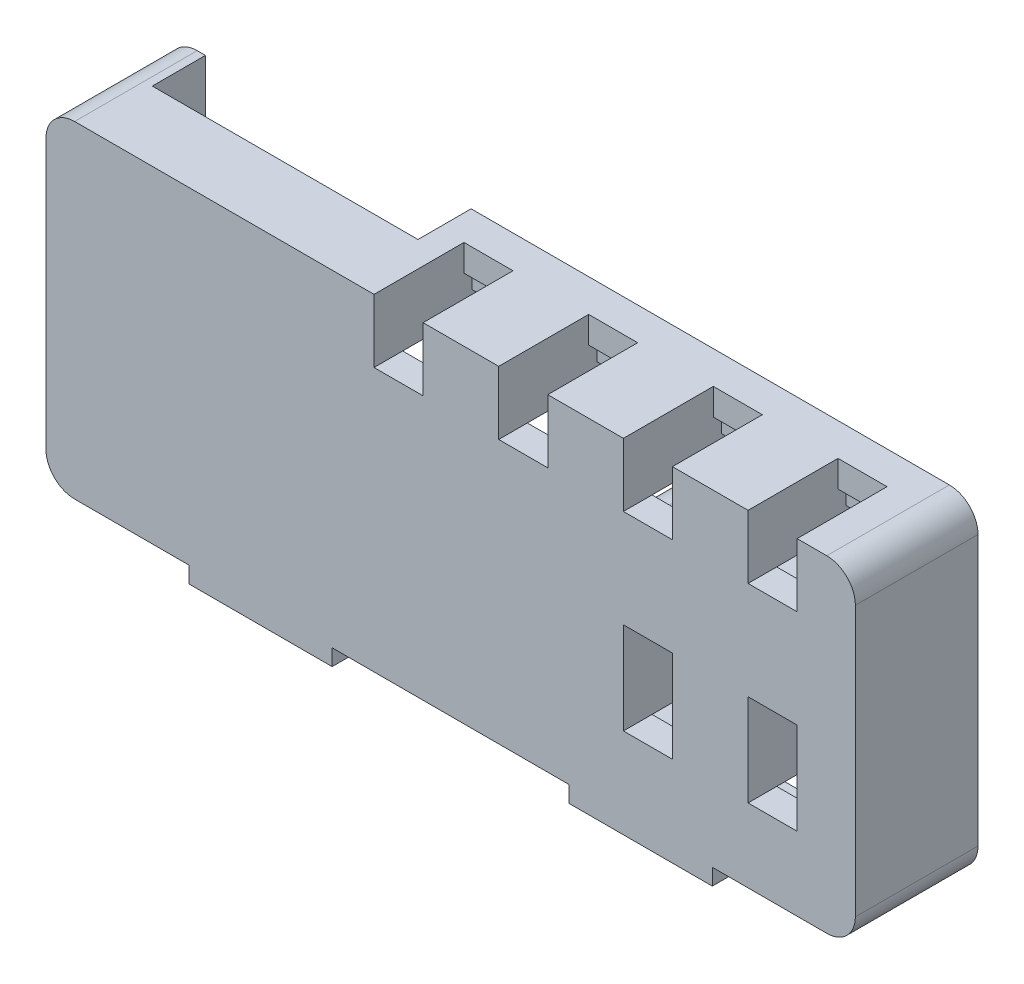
ISO-10303-21;
HEADER;
FILE_DESCRIPTION(('STEP AP214'),'2;1');
FILE_NAME('part.step','',(''),(''),'','','');
FILE_SCHEMA(('AUTOMOTIVE_DESIGN { 1 0 10303 214 1 1 1 1 }'));
ENDSEC;
DATA;
#1=APPLICATION_CONTEXT('core data for automotive mechanical design processes');
#2=APPLICATION_PROTOCOL_DEFINITION('international standard','automotive_design',2000,#1);
#3=PRODUCT_CONTEXT('',#1,'mechanical');
#4=PRODUCT('Part','Part','',(#3));
#5=PRODUCT_RELATED_PRODUCT_CATEGORY('part','',(#4));
#6=PRODUCT_DEFINITION_FORMATION('','',#4);
#7=PRODUCT_DEFINITION_CONTEXT('part definition',#1,'design');
#8=PRODUCT_DEFINITION('design','',#6,#7);
#9=PRODUCT_DEFINITION_SHAPE('','',#8);
#10=(LENGTH_UNIT() NAMED_UNIT(*) SI_UNIT(.MILLI.,.METRE.));
#11=(NAMED_UNIT(*) PLANE_ANGLE_UNIT() SI_UNIT($,.RADIAN.));
#12=(NAMED_UNIT(*) SI_UNIT($,.STERADIAN.) SOLID_ANGLE_UNIT());
#13=UNCERTAINTY_MEASURE_WITH_UNIT(LENGTH_MEASURE(1.E-05),#10,'distance_accuracy_value','');
#14=(GEOMETRIC_REPRESENTATION_CONTEXT(3) GLOBAL_UNCERTAINTY_ASSIGNED_CONTEXT((#13)) GLOBAL_UNIT_ASSIGNED_CONTEXT((#10,
#11,#12)) REPRESENTATION_CONTEXT('',''));
#15=CARTESIAN_POINT('',(0.,0.,0.));
#16=DIRECTION('',(0.,0.,1.));
#17=DIRECTION('',(1.,0.,0.));
#18=AXIS2_PLACEMENT_3D('',#15,#16,#17);
#19=CARTESIAN_POINT('',(-11.5131827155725,-10.1940321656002,7.6));
#20=DIRECTION('',(1.,0.,0.));
#21=DIRECTION('',(0.,0.,-1.));
#22=AXIS2_PLACEMENT_3D('',#19,#20,#21);
#23=PLANE('',#22);
#24=DIRECTION('',(0.,-1.,0.));
#25=VECTOR('',#24,1.);
#26=CARTESIAN_POINT('',(-11.5131827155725,-10.1940321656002,0.));
#27=LINE('',#26,#25);
#28=CARTESIAN_POINT('',(-11.5131827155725,-9.09403216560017,0.));
#29=VERTEX_POINT('',#28);
#30=CARTESIAN_POINT('',(-11.5131827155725,-10.1940321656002,0.));
#31=VERTEX_POINT('',#30);
#32=EDGE_CURVE('E574',#29,#31,#27,.T.);
#33=ORIENTED_EDGE('',*,*,#32,.F.);
#34=DIRECTION('',(0.,0.,-1.));
#35=VECTOR('',#34,1.);
#36=CARTESIAN_POINT('',(-11.5131827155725,-9.09403216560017,1.2));
#37=LINE('',#36,#35);
#38=CARTESIAN_POINT('',(-11.5131827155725,-9.09403216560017,1.2));
#39=VERTEX_POINT('',#38);
#40=EDGE_CURVE('E555',#39,#29,#37,.T.);
#41=ORIENTED_EDGE('',*,*,#40,.F.);
#42=DIRECTION('',(0.,-1.,0.));
#43=VECTOR('',#42,1.);
#44=CARTESIAN_POINT('',(-11.5131827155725,-5.69403216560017,1.2));
#45=LINE('',#44,#43);
#46=CARTESIAN_POINT('',(-11.5131827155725,-5.69403216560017,1.2));
#47=VERTEX_POINT('',#46);
#48=EDGE_CURVE('E565',#47,#39,#45,.T.);
#49=ORIENTED_EDGE('',*,*,#48,.F.);
#50=DIRECTION('',(0.,0.,-1.));
#51=VECTOR('',#50,1.);
#52=CARTESIAN_POINT('',(-11.5131827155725,-5.69403216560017,5.));
#53=LINE('',#52,#51);
#54=CARTESIAN_POINT('',(-11.5131827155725,-5.69403216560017,6.));
#55=VERTEX_POINT('',#54);
#56=EDGE_CURVE('E846',#55,#47,#53,.T.);
#57=ORIENTED_EDGE('',*,*,#56,.F.);
#58=DIRECTION('',(0.,-1.,0.));
#59=VECTOR('',#58,1.);
#60=CARTESIAN_POINT('',(-11.5131827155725,-10.1940321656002,6.));
#61=LINE('',#60,#59);
#62=CARTESIAN_POINT('',(-11.5131827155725,-10.1940321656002,6.));
#63=VERTEX_POINT('',#62);
#64=EDGE_CURVE('E664',#55,#63,#61,.T.);
#65=ORIENTED_EDGE('',*,*,#64,.T.);
#66=DIRECTION('',(0.,0.,-1.));
#67=VECTOR('',#66,1.);
#68=CARTESIAN_POINT('',(-11.5131827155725,-10.1940321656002,6.));
#69=LINE('',#68,#67);
#70=CARTESIAN_POINT('',(-11.5131827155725,-10.1940321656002,4.6));
#71=VERTEX_POINT('',#70);
#72=EDGE_CURVE('E679',#63,#71,#69,.T.);
#73=ORIENTED_EDGE('',*,*,#72,.T.);
#74=DIRECTION('',(0.,0.,-1.));
#75=VECTOR('',#74,1.);
#76=CARTESIAN_POINT('',(-11.5131827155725,-10.1940321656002,7.6));
#77=LINE('',#76,#75);
#78=EDGE_CURVE('E973',#71,#31,#77,.T.);
#79=ORIENTED_EDGE('',*,*,#78,.T.);
#80=EDGE_LOOP('',(#33,#41,#49,#57,#65,#73,#79));
#81=FACE_BOUND('',#80,.T.);
#82=ADVANCED_FACE('F35',(#81),#23,.T.);
#83=CARTESIAN_POINT('',(-9.11318271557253,-10.1940321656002,7.6));
#84=DIRECTION('',(-1.,0.,0.));
#85=DIRECTION('',(0.,0.,1.));
#86=AXIS2_PLACEMENT_3D('',#83,#84,#85);
#87=PLANE('',#86);
#88=DIRECTION('',(0.,1.,0.));
#89=VECTOR('',#88,1.);
#90=CARTESIAN_POINT('',(-9.11318271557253,-10.1940321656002,1.2));
#91=LINE('',#90,#89);
#92=CARTESIAN_POINT('',(-9.11318271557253,-9.09403216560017,1.2));
#93=VERTEX_POINT('',#92);
#94=CARTESIAN_POINT('',(-9.11318271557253,-5.69403216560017,1.2));
#95=VERTEX_POINT('',#94);
#96=EDGE_CURVE('E578',#93,#95,#91,.T.);
#97=ORIENTED_EDGE('',*,*,#96,.F.);
#98=DIRECTION('',(0.,0.,-1.));
#99=VECTOR('',#98,1.);
#100=CARTESIAN_POINT('',(-9.11318271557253,-9.09403216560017,7.6));
#101=LINE('',#100,#99);
#102=CARTESIAN_POINT('',(-9.11318271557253,-9.09403216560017,0.));
#103=VERTEX_POINT('',#102);
#104=EDGE_CURVE('E558',#93,#103,#101,.T.);
#105=ORIENTED_EDGE('',*,*,#104,.T.);
#106=DIRECTION('',(0.,1.,0.));
#107=VECTOR('',#106,1.);
#108=CARTESIAN_POINT('',(-9.11318271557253,-10.1940321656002,0.));
#109=LINE('',#108,#107);
#110=CARTESIAN_POINT('',(-9.11318271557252,-10.1940321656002,0.));
#111=VERTEX_POINT('',#110);
#112=EDGE_CURVE('E968',#111,#103,#109,.T.);
#113=ORIENTED_EDGE('',*,*,#112,.F.);
#114=DIRECTION('',(0.,0.,-1.));
#115=VECTOR('',#114,1.);
#116=CARTESIAN_POINT('',(-9.11318271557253,-10.1940321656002,7.6));
#117=LINE('',#116,#115);
#118=CARTESIAN_POINT('',(-9.11318271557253,-10.1940321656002,4.6));
#119=VERTEX_POINT('',#118);
#120=EDGE_CURVE('E971',#119,#111,#117,.T.);
#121=ORIENTED_EDGE('',*,*,#120,.F.);
#122=DIRECTION('',(0.,0.,-1.));
#123=VECTOR('',#122,1.);
#124=CARTESIAN_POINT('',(-9.11318271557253,-10.1940321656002,6.));
#125=LINE('',#124,#123);
#126=CARTESIAN_POINT('',(-9.11318271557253,-10.1940321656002,6.));
#127=VERTEX_POINT('',#126);
#128=EDGE_CURVE('E674',#127,#119,#125,.T.);
#129=ORIENTED_EDGE('',*,*,#128,.F.);
#130=DIRECTION('',(0.,1.,0.));
#131=VECTOR('',#130,1.);
#132=CARTESIAN_POINT('',(-9.11318271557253,-10.1940321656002,6.));
#133=LINE('',#132,#131);
#134=CARTESIAN_POINT('',(-9.11318271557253,-5.69403216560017,6.));
#135=VERTEX_POINT('',#134);
#136=EDGE_CURVE('E668',#127,#135,#133,.T.);
#137=ORIENTED_EDGE('',*,*,#136,.T.);
#138=DIRECTION('',(0.,0.,-1.));
#139=VECTOR('',#138,1.);
#140=CARTESIAN_POINT('',(-9.11318271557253,-5.69403216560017,5.));
#141=LINE('',#140,#139);
#142=EDGE_CURVE('E848',#135,#95,#141,.T.);
#143=ORIENTED_EDGE('',*,*,#142,.T.);
#144=EDGE_LOOP('',(#97,#105,#113,#121,#129,#137,#143));
#145=FACE_BOUND('',#144,.T.);
#146=ADVANCED_FACE('F1321',(#145),#87,.T.);
#147=CARTESIAN_POINT('',(-5.41318271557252,-10.1940321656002,7.6));
#148=DIRECTION('',(1.,0.,0.));
#149=DIRECTION('',(0.,0.,-1.));
#150=AXIS2_PLACEMENT_3D('',#147,#148,#149);
#151=PLANE('',#150);
#152=DIRECTION('',(0.,-1.,0.));
#153=VECTOR('',#152,1.);
#154=CARTESIAN_POINT('',(-5.41318271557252,-10.1940321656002,0.));
#155=LINE('',#154,#153);
#156=CARTESIAN_POINT('',(-5.41318271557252,-9.09403216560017,0.));
#157=VERTEX_POINT('',#156);
#158=CARTESIAN_POINT('',(-5.41318271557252,-10.1940321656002,0.));
#159=VERTEX_POINT('',#158);
#160=EDGE_CURVE('E949',#157,#159,#155,.T.);
#161=ORIENTED_EDGE('',*,*,#160,.F.);
#162=DIRECTION('',(0.,0.,1.));
#163=VECTOR('',#162,1.);
#164=CARTESIAN_POINT('',(-5.41318271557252,-9.09403216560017,7.6));
#165=LINE('',#164,#163);
#166=CARTESIAN_POINT('',(-5.41318271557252,-9.09403216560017,1.2));
#167=VERTEX_POINT('',#166);
#168=EDGE_CURVE('E586',#157,#167,#165,.T.);
#169=ORIENTED_EDGE('',*,*,#168,.T.);
#170=DIRECTION('',(0.,-1.,0.));
#171=VECTOR('',#170,1.);
#172=CARTESIAN_POINT('',(-5.41318271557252,-10.1940321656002,1.2));
#173=LINE('',#172,#171);
#174=CARTESIAN_POINT('',(-5.41318271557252,-5.69403216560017,1.2));
#175=VERTEX_POINT('',#174);
#176=EDGE_CURVE('E575',#175,#167,#173,.T.);
#177=ORIENTED_EDGE('',*,*,#176,.F.);
#178=DIRECTION('',(0.,0.,-1.));
#179=VECTOR('',#178,1.);
#180=CARTESIAN_POINT('',(-5.41318271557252,-5.69403216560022,5.));
#181=LINE('',#180,#179);
#182=CARTESIAN_POINT('',(-5.41318271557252,-5.69403216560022,6.));
#183=VERTEX_POINT('',#182);
#184=EDGE_CURVE('E827',#183,#175,#181,.T.);
#185=ORIENTED_EDGE('',*,*,#184,.F.);
#186=DIRECTION('',(0.,-1.,0.));
#187=VECTOR('',#186,1.);
#188=CARTESIAN_POINT('',(-5.41318271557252,-10.1940321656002,6.));
#189=LINE('',#188,#187);
#190=CARTESIAN_POINT('',(-5.41318271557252,-10.1940321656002,6.));
#191=VERTEX_POINT('',#190);
#192=EDGE_CURVE('E645',#183,#191,#189,.T.);
#193=ORIENTED_EDGE('',*,*,#192,.T.);
#194=DIRECTION('',(0.,0.,-1.));
#195=VECTOR('',#194,1.);
#196=CARTESIAN_POINT('',(-5.41318271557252,-10.1940321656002,6.));
#197=LINE('',#196,#195);
#198=CARTESIAN_POINT('',(-5.41318271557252,-10.1940321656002,4.6));
#199=VERTEX_POINT('',#198);
#200=EDGE_CURVE('E660',#191,#199,#197,.T.);
#201=ORIENTED_EDGE('',*,*,#200,.T.);
#202=DIRECTION('',(0.,0.,-1.));
#203=VECTOR('',#202,1.);
#204=CARTESIAN_POINT('',(-5.41318271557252,-10.1940321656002,7.6));
#205=LINE('',#204,#203);
#206=EDGE_CURVE('E982',#199,#159,#205,.T.);
#207=ORIENTED_EDGE('',*,*,#206,.T.);
#208=EDGE_LOOP('',(#161,#169,#177,#185,#193,#201,#207));
#209=FACE_BOUND('',#208,.T.);
#210=ADVANCED_FACE('F1326',(#209),#151,.T.);
#211=CARTESIAN_POINT('',(-3.01318271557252,-10.1940321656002,7.6));
#212=DIRECTION('',(-1.,0.,0.));
#213=DIRECTION('',(0.,-1.,0.));
#214=AXIS2_PLACEMENT_3D('',#211,#212,#213);
#215=PLANE('',#214);
#216=DIRECTION('',(0.,1.,0.));
#217=VECTOR('',#216,1.);
#218=CARTESIAN_POINT('',(-3.01318271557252,-5.69403216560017,1.2));
#219=LINE('',#218,#217);
#220=CARTESIAN_POINT('',(-3.01318271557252,-9.09403216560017,1.2));
#221=VERTEX_POINT('',#220);
#222=CARTESIAN_POINT('',(-3.01318271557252,-5.69403216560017,1.2));
#223=VERTEX_POINT('',#222);
#224=EDGE_CURVE('E561',#221,#223,#219,.T.);
#225=ORIENTED_EDGE('',*,*,#224,.F.);
#226=DIRECTION('',(0.,0.,-1.));
#227=VECTOR('',#226,1.);
#228=CARTESIAN_POINT('',(-3.01318271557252,-9.09403216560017,1.2));
#229=LINE('',#228,#227);
#230=CARTESIAN_POINT('',(-3.01318271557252,-9.09403216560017,0.));
#231=VERTEX_POINT('',#230);
#232=EDGE_CURVE('E576',#221,#231,#229,.T.);
#233=ORIENTED_EDGE('',*,*,#232,.T.);
#234=DIRECTION('',(0.,1.,0.));
#235=VECTOR('',#234,1.);
#236=CARTESIAN_POINT('',(-3.01318271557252,-10.1940321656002,0.));
#237=LINE('',#236,#235);
#238=CARTESIAN_POINT('',(-3.01318271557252,-10.1940321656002,0.));
#239=VERTEX_POINT('',#238);
#240=EDGE_CURVE('E974',#239,#231,#237,.T.);
#241=ORIENTED_EDGE('',*,*,#240,.F.);
#242=DIRECTION('',(0.,0.,-1.));
#243=VECTOR('',#242,1.);
#244=CARTESIAN_POINT('',(-3.01318271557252,-10.1940321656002,7.6));
#245=LINE('',#244,#243);
#246=CARTESIAN_POINT('',(-3.01318271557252,-10.1940321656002,4.6));
#247=VERTEX_POINT('',#246);
#248=EDGE_CURVE('E980',#247,#239,#245,.T.);
#249=ORIENTED_EDGE('',*,*,#248,.F.);
#250=DIRECTION('',(0.,0.,-1.));
#251=VECTOR('',#250,1.);
#252=CARTESIAN_POINT('',(-3.01318271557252,-10.1940321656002,6.));
#253=LINE('',#252,#251);
#254=CARTESIAN_POINT('',(-3.01318271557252,-10.1940321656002,6.));
#255=VERTEX_POINT('',#254);
#256=EDGE_CURVE('E655',#255,#247,#253,.T.);
#257=ORIENTED_EDGE('',*,*,#256,.F.);
#258=DIRECTION('',(0.,1.,0.));
#259=VECTOR('',#258,1.);
#260=CARTESIAN_POINT('',(-3.01318271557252,-10.1940321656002,6.));
#261=LINE('',#260,#259);
#262=CARTESIAN_POINT('',(-3.01318271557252,-5.69403216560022,6.));
#263=VERTEX_POINT('',#262);
#264=EDGE_CURVE('E649',#255,#263,#261,.T.);
#265=ORIENTED_EDGE('',*,*,#264,.T.);
#266=DIRECTION('',(0.,0.,-1.));
#267=VECTOR('',#266,1.);
#268=CARTESIAN_POINT('',(-3.01318271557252,-5.69403216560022,5.));
#269=LINE('',#268,#267);
#270=EDGE_CURVE('E843',#263,#223,#269,.T.);
#271=ORIENTED_EDGE('',*,*,#270,.T.);
#272=EDGE_LOOP('',(#225,#233,#241,#249,#257,#265,#271));
#273=FACE_BOUND('',#272,.T.);
#274=ADVANCED_FACE('F1331',(#273),#215,.T.);
#275=CARTESIAN_POINT('',(-23.7131827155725,-0.894032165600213,7.6));
#276=DIRECTION('',(1.,0.,0.));
#277=DIRECTION('',(0.,0.,-1.));
#278=AXIS2_PLACEMENT_3D('',#275,#276,#277);
#279=PLANE('',#278);
#280=DIRECTION('',(0.,-1.,0.));
#281=VECTOR('',#280,1.);
#282=CARTESIAN_POINT('',(-23.7131827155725,-0.894032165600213,0.));
#283=LINE('',#282,#281);
#284=CARTESIAN_POINT('',(-23.7131827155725,0.00596783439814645,0.));
#285=VERTEX_POINT('',#284);
#286=CARTESIAN_POINT('',(-23.7131827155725,-0.894032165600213,0.));
#287=VERTEX_POINT('',#286);
#288=EDGE_CURVE('E1026',#285,#287,#283,.T.);
#289=ORIENTED_EDGE('',*,*,#288,.F.);
#290=DIRECTION('',(0.,0.,-1.));
#291=VECTOR('',#290,1.);
#292=CARTESIAN_POINT('',(-23.7131827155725,0.00596783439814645,1.2));
#293=LINE('',#292,#291);
#294=CARTESIAN_POINT('',(-23.7131827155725,0.00596783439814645,1.2));
#295=VERTEX_POINT('',#294);
#296=EDGE_CURVE('E611',#295,#285,#293,.T.);
#297=ORIENTED_EDGE('',*,*,#296,.F.);
#298=DIRECTION('',(0.,-1.,0.));
#299=VECTOR('',#298,1.);
#300=CARTESIAN_POINT('',(-23.7131827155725,0.905967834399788,1.2));
#301=LINE('',#300,#299);
#302=CARTESIAN_POINT('',(-23.7131827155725,0.905967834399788,1.2));
#303=VERTEX_POINT('',#302);
#304=EDGE_CURVE('E591',#303,#295,#301,.T.);
#305=ORIENTED_EDGE('',*,*,#304,.F.);
#306=DIRECTION('',(0.,0.,-1.));
#307=VECTOR('',#306,1.);
#308=CARTESIAN_POINT('',(-23.7131827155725,0.905967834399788,7.6));
#309=LINE('',#308,#307);
#310=CARTESIAN_POINT('',(-23.7131827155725,0.905967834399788,1.6));
#311=VERTEX_POINT('',#310);
#312=EDGE_CURVE('E1002',#311,#303,#309,.T.);
#313=ORIENTED_EDGE('',*,*,#312,.F.);
#314=DIRECTION('',(0.,1.,0.));
#315=VECTOR('',#314,1.);
#316=CARTESIAN_POINT('',(-23.7131827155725,-0.794032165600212,1.6));
#317=LINE('',#316,#315);
#318=CARTESIAN_POINT('',(-23.7131827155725,2.20596783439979,1.6));
#319=VERTEX_POINT('',#318);
#320=EDGE_CURVE('E896',#311,#319,#317,.T.);
#321=ORIENTED_EDGE('',*,*,#320,.T.);
#322=DIRECTION('',(0.,0.,1.));
#323=VECTOR('',#322,1.);
#324=CARTESIAN_POINT('',(-23.7131827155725,2.20596783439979,4.6));
#325=LINE('',#324,#323);
#326=CARTESIAN_POINT('',(-23.7131827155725,2.20596783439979,6.));
#327=VERTEX_POINT('',#326);
#328=EDGE_CURVE('E864',#319,#327,#325,.T.);
#329=ORIENTED_EDGE('',*,*,#328,.T.);
#330=DIRECTION('',(0.,1.,0.));
#331=VECTOR('',#330,1.);
#332=CARTESIAN_POINT('',(-23.7131827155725,2.20596783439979,6.));
#333=LINE('',#332,#331);
#334=CARTESIAN_POINT('',(-23.7131827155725,-0.894032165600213,6.));
#335=VERTEX_POINT('',#334);
#336=EDGE_CURVE('E749',#335,#327,#333,.T.);
#337=ORIENTED_EDGE('',*,*,#336,.F.);
#338=DIRECTION('',(0.,0.,-1.));
#339=VECTOR('',#338,1.);
#340=CARTESIAN_POINT('',(-23.7131827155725,-0.894032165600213,6.));
#341=LINE('',#340,#339);
#342=CARTESIAN_POINT('',(-23.7131827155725,-0.894032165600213,4.6));
#343=VERTEX_POINT('',#342);
#344=EDGE_CURVE('E758',#335,#343,#341,.T.);
#345=ORIENTED_EDGE('',*,*,#344,.T.);
#346=DIRECTION('',(0.,0.,-1.));
#347=VECTOR('',#346,1.);
#348=CARTESIAN_POINT('',(-23.7131827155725,-0.894032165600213,7.6));
#349=LINE('',#348,#347);
#350=EDGE_CURVE('E1028',#343,#287,#349,.T.);
#351=ORIENTED_EDGE('',*,*,#350,.T.);
#352=EDGE_LOOP('',(#289,#297,#305,#313,#321,#329,#337,#345,#351));
#353=FACE_BOUND('',#352,.T.);
#354=ADVANCED_FACE('F1185',(#353),#279,.T.);
#355=CARTESIAN_POINT('',(-21.3131827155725,-0.894032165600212,7.6));
#356=DIRECTION('',(-1.,0.,0.));
#357=DIRECTION('',(0.,0.,1.));
#358=AXIS2_PLACEMENT_3D('',#355,#356,#357);
#359=PLANE('',#358);
#360=DIRECTION('',(0.,1.,0.));
#361=VECTOR('',#360,1.);
#362=CARTESIAN_POINT('',(-21.3131827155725,-0.894032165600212,1.2));
#363=LINE('',#362,#361);
#364=CARTESIAN_POINT('',(-21.3131827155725,0.00596783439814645,1.2));
#365=VERTEX_POINT('',#364);
#366=CARTESIAN_POINT('',(-21.3131827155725,0.905967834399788,1.2));
#367=VERTEX_POINT('',#366);
#368=EDGE_CURVE('E624',#365,#367,#363,.T.);
#369=ORIENTED_EDGE('',*,*,#368,.F.);
#370=DIRECTION('',(0.,0.,-1.));
#371=VECTOR('',#370,1.);
#372=CARTESIAN_POINT('',(-21.3131827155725,0.00596783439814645,7.6));
#373=LINE('',#372,#371);
#374=CARTESIAN_POINT('',(-21.3131827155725,0.00596783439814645,0.));
#375=VERTEX_POINT('',#374);
#376=EDGE_CURVE('E641',#365,#375,#373,.T.);
#377=ORIENTED_EDGE('',*,*,#376,.T.);
#378=DIRECTION('',(0.,1.,0.));
#379=VECTOR('',#378,1.);
#380=CARTESIAN_POINT('',(-21.3131827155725,-0.894032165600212,0.));
#381=LINE('',#380,#379);
#382=CARTESIAN_POINT('',(-21.3131827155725,-0.894032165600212,0.));
#383=VERTEX_POINT('',#382);
#384=EDGE_CURVE('E1021',#383,#375,#381,.T.);
#385=ORIENTED_EDGE('',*,*,#384,.F.);
#386=DIRECTION('',(0.,0.,-1.));
#387=VECTOR('',#386,1.);
#388=CARTESIAN_POINT('',(-21.3131827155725,-0.894032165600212,7.6));
#389=LINE('',#388,#387);
#390=CARTESIAN_POINT('',(-21.3131827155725,-0.894032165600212,4.6));
#391=VERTEX_POINT('',#390);
#392=EDGE_CURVE('E1025',#391,#383,#389,.T.);
#393=ORIENTED_EDGE('',*,*,#392,.F.);
#394=DIRECTION('',(0.,0.,-1.));
#395=VECTOR('',#394,1.);
#396=CARTESIAN_POINT('',(-21.3131827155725,-0.894032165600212,6.));
#397=LINE('',#396,#395);
#398=CARTESIAN_POINT('',(-21.3131827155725,-0.894032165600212,6.));
#399=VERTEX_POINT('',#398);
#400=EDGE_CURVE('E771',#399,#391,#397,.T.);
#401=ORIENTED_EDGE('',*,*,#400,.F.);
#402=DIRECTION('',(0.,-1.,0.));
#403=VECTOR('',#402,1.);
#404=CARTESIAN_POINT('',(-21.3131827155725,-0.894032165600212,6.));
#405=LINE('',#404,#403);
#406=CARTESIAN_POINT('',(-21.3131827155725,2.20596783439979,6.));
#407=VERTEX_POINT('',#406);
#408=EDGE_CURVE('E745',#407,#399,#405,.T.);
#409=ORIENTED_EDGE('',*,*,#408,.F.);
#410=DIRECTION('',(0.,0.,-1.));
#411=VECTOR('',#410,1.);
#412=CARTESIAN_POINT('',(-21.3131827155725,2.20596783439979,4.6));
#413=LINE('',#412,#411);
#414=CARTESIAN_POINT('',(-21.3131827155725,2.20596783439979,1.6));
#415=VERTEX_POINT('',#414);
#416=EDGE_CURVE('E889',#407,#415,#413,.T.);
#417=ORIENTED_EDGE('',*,*,#416,.T.);
#418=DIRECTION('',(0.,1.,0.));
#419=VECTOR('',#418,1.);
#420=CARTESIAN_POINT('',(-21.3131827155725,-0.794032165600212,1.6));
#421=LINE('',#420,#419);
#422=CARTESIAN_POINT('',(-21.3131827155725,0.905967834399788,1.6));
#423=VERTEX_POINT('',#422);
#424=EDGE_CURVE('E895',#423,#415,#421,.T.);
#425=ORIENTED_EDGE('',*,*,#424,.F.);
#426=DIRECTION('',(0.,0.,-1.));
#427=VECTOR('',#426,1.);
#428=CARTESIAN_POINT('',(-21.3131827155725,0.905967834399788,7.6));
#429=LINE('',#428,#427);
#430=EDGE_CURVE('E1024',#423,#367,#429,.T.);
#431=ORIENTED_EDGE('',*,*,#430,.T.);
#432=EDGE_LOOP('',(#369,#377,#385,#393,#401,#409,#417,#425,#431));
#433=FACE_BOUND('',#432,.T.);
#434=ADVANCED_FACE('F1195',(#433),#359,.T.);
#435=CARTESIAN_POINT('',(-17.6131827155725,-0.894032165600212,7.6));
#436=DIRECTION('',(1.,0.,0.));
#437=DIRECTION('',(0.,0.,-1.));
#438=AXIS2_PLACEMENT_3D('',#435,#436,#437);
#439=PLANE('',#438);
#440=DIRECTION('',(0.,-1.,0.));
#441=VECTOR('',#440,1.);
#442=CARTESIAN_POINT('',(-17.6131827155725,-0.894032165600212,0.));
#443=LINE('',#442,#441);
#444=CARTESIAN_POINT('',(-17.6131827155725,0.00596783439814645,0.));
#445=VERTEX_POINT('',#444);
#446=CARTESIAN_POINT('',(-17.6131827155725,-0.894032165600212,0.));
#447=VERTEX_POINT('',#446);
#448=EDGE_CURVE('E992',#445,#447,#443,.T.);
#449=ORIENTED_EDGE('',*,*,#448,.F.);
#450=DIRECTION('',(0.,0.,1.));
#451=VECTOR('',#450,1.);
#452=CARTESIAN_POINT('',(-17.6131827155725,0.00596783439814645,7.6));
#453=LINE('',#452,#451);
#454=CARTESIAN_POINT('',(-17.6131827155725,0.00596783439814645,1.2));
#455=VERTEX_POINT('',#454);
#456=EDGE_CURVE('E638',#445,#455,#453,.T.);
#457=ORIENTED_EDGE('',*,*,#456,.T.);
#458=DIRECTION('',(0.,-1.,0.));
#459=VECTOR('',#458,1.);
#460=CARTESIAN_POINT('',(-17.6131827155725,-0.894032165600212,1.2));
#461=LINE('',#460,#459);
#462=CARTESIAN_POINT('',(-17.6131827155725,0.905967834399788,1.2));
#463=VERTEX_POINT('',#462);
#464=EDGE_CURVE('E622',#463,#455,#461,.T.);
#465=ORIENTED_EDGE('',*,*,#464,.F.);
#466=DIRECTION('',(0.,0.,-1.));
#467=VECTOR('',#466,1.);
#468=CARTESIAN_POINT('',(-17.6131827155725,0.905967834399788,7.6));
#469=LINE('',#468,#467);
#470=CARTESIAN_POINT('',(-17.6131827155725,0.905967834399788,1.6));
#471=VERTEX_POINT('',#470);
#472=EDGE_CURVE('E995',#471,#463,#469,.T.);
#473=ORIENTED_EDGE('',*,*,#472,.F.);
#474=DIRECTION('',(0.,1.,0.));
#475=VECTOR('',#474,1.);
#476=CARTESIAN_POINT('',(-17.6131827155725,-0.794032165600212,1.6));
#477=LINE('',#476,#475);
#478=CARTESIAN_POINT('',(-17.6131827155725,2.20596783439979,1.6));
#479=VERTEX_POINT('',#478);
#480=EDGE_CURVE('E862',#471,#479,#477,.T.);
#481=ORIENTED_EDGE('',*,*,#480,.T.);
#482=DIRECTION('',(0.,0.,1.));
#483=VECTOR('',#482,1.);
#484=CARTESIAN_POINT('',(-17.6131827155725,2.20596783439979,4.6));
#485=LINE('',#484,#483);
#486=CARTESIAN_POINT('',(-17.6131827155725,2.20596783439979,6.));
#487=VERTEX_POINT('',#486);
#488=EDGE_CURVE('E852',#479,#487,#485,.T.);
#489=ORIENTED_EDGE('',*,*,#488,.T.);
#490=DIRECTION('',(0.,1.,0.));
#491=VECTOR('',#490,1.);
#492=CARTESIAN_POINT('',(-17.6131827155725,2.20596783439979,6.));
#493=LINE('',#492,#491);
#494=CARTESIAN_POINT('',(-17.6131827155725,-0.894032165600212,6.));
#495=VERTEX_POINT('',#494);
#496=EDGE_CURVE('E739',#495,#487,#493,.T.);
#497=ORIENTED_EDGE('',*,*,#496,.F.);
#498=DIRECTION('',(0.,0.,-1.));
#499=VECTOR('',#498,1.);
#500=CARTESIAN_POINT('',(-17.6131827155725,-0.894032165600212,6.));
#501=LINE('',#500,#499);
#502=CARTESIAN_POINT('',(-17.6131827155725,-0.894032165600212,4.6));
#503=VERTEX_POINT('',#502);
#504=EDGE_CURVE('E773',#495,#503,#501,.T.);
#505=ORIENTED_EDGE('',*,*,#504,.T.);
#506=DIRECTION('',(0.,0.,-1.));
#507=VECTOR('',#506,1.);
#508=CARTESIAN_POINT('',(-17.6131827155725,-0.894032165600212,7.6));
#509=LINE('',#508,#507);
#510=EDGE_CURVE('E994',#503,#447,#509,.T.);
#511=ORIENTED_EDGE('',*,*,#510,.T.);
#512=EDGE_LOOP('',(#449,#457,#465,#473,#481,#489,#497,#505,#511));
#513=FACE_BOUND('',#512,.T.);
#514=ADVANCED_FACE('F1204',(#513),#439,.T.);
#515=CARTESIAN_POINT('',(-15.2131827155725,-0.894032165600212,7.6));
#516=DIRECTION('',(-1.,0.,0.));
#517=DIRECTION('',(0.,0.,1.));
#518=AXIS2_PLACEMENT_3D('',#515,#516,#517);
#519=PLANE('',#518);
#520=DIRECTION('',(0.,1.,0.));
#521=VECTOR('',#520,1.);
#522=CARTESIAN_POINT('',(-15.2131827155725,-0.894032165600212,1.2));
#523=LINE('',#522,#521);
#524=CARTESIAN_POINT('',(-15.2131827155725,0.00596783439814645,1.2));
#525=VERTEX_POINT('',#524);
#526=CARTESIAN_POINT('',(-15.2131827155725,0.905967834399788,1.2));
#527=VERTEX_POINT('',#526);
#528=EDGE_CURVE('E620',#525,#527,#523,.T.);
#529=ORIENTED_EDGE('',*,*,#528,.F.);
#530=DIRECTION('',(0.,0.,-1.));
#531=VECTOR('',#530,1.);
#532=CARTESIAN_POINT('',(-15.2131827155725,0.00596783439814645,7.6));
#533=LINE('',#532,#531);
#534=CARTESIAN_POINT('',(-15.2131827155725,0.00596783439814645,0.));
#535=VERTEX_POINT('',#534);
#536=EDGE_CURVE('E635',#525,#535,#533,.T.);
#537=ORIENTED_EDGE('',*,*,#536,.T.);
#538=DIRECTION('',(0.,1.,0.));
#539=VECTOR('',#538,1.);
#540=CARTESIAN_POINT('',(-15.2131827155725,-0.894032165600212,0.));
#541=LINE('',#540,#539);
#542=CARTESIAN_POINT('',(-15.2131827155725,-0.894032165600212,0.));
#543=VERTEX_POINT('',#542);
#544=EDGE_CURVE('E987',#543,#535,#541,.T.);
#545=ORIENTED_EDGE('',*,*,#544,.F.);
#546=DIRECTION('',(0.,0.,-1.));
#547=VECTOR('',#546,1.);
#548=CARTESIAN_POINT('',(-15.2131827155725,-0.894032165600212,7.6));
#549=LINE('',#548,#547);
#550=CARTESIAN_POINT('',(-15.2131827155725,-0.894032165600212,4.6));
#551=VERTEX_POINT('',#550);
#552=EDGE_CURVE('E991',#551,#543,#549,.T.);
#553=ORIENTED_EDGE('',*,*,#552,.F.);
#554=DIRECTION('',(0.,0.,-1.));
#555=VECTOR('',#554,1.);
#556=CARTESIAN_POINT('',(-15.2131827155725,-0.894032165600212,6.));
#557=LINE('',#556,#555);
#558=CARTESIAN_POINT('',(-15.2131827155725,-0.894032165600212,6.));
#559=VERTEX_POINT('',#558);
#560=EDGE_CURVE('E775',#559,#551,#557,.T.);
#561=ORIENTED_EDGE('',*,*,#560,.F.);
#562=DIRECTION('',(0.,-1.,0.));
#563=VECTOR('',#562,1.);
#564=CARTESIAN_POINT('',(-15.2131827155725,-0.894032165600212,6.));
#565=LINE('',#564,#563);
#566=CARTESIAN_POINT('',(-15.2131827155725,2.20596783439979,6.));
#567=VERTEX_POINT('',#566);
#568=EDGE_CURVE('E735',#567,#559,#565,.T.);
#569=ORIENTED_EDGE('',*,*,#568,.F.);
#570=DIRECTION('',(0.,0.,-1.));
#571=VECTOR('',#570,1.);
#572=CARTESIAN_POINT('',(-15.2131827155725,2.20596783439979,4.6));
#573=LINE('',#572,#571);
#574=CARTESIAN_POINT('',(-15.2131827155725,2.20596783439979,1.6));
#575=VERTEX_POINT('',#574);
#576=EDGE_CURVE('E854',#567,#575,#573,.T.);
#577=ORIENTED_EDGE('',*,*,#576,.T.);
#578=DIRECTION('',(0.,1.,0.));
#579=VECTOR('',#578,1.);
#580=CARTESIAN_POINT('',(-15.2131827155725,-0.794032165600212,1.6));
#581=LINE('',#580,#579);
#582=CARTESIAN_POINT('',(-15.2131827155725,0.905967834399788,1.6));
#583=VERTEX_POINT('',#582);
#584=EDGE_CURVE('E861',#583,#575,#581,.T.);
#585=ORIENTED_EDGE('',*,*,#584,.F.);
#586=DIRECTION('',(0.,0.,-1.));
#587=VECTOR('',#586,1.);
#588=CARTESIAN_POINT('',(-15.2131827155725,0.905967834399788,7.6));
#589=LINE('',#588,#587);
#590=EDGE_CURVE('E990',#583,#527,#589,.T.);
#591=ORIENTED_EDGE('',*,*,#590,.T.);
#592=EDGE_LOOP('',(#529,#537,#545,#553,#561,#569,#577,#585,#591));
#593=FACE_BOUND('',#592,.T.);
#594=ADVANCED_FACE('F1215',(#593),#519,.T.);
#595=CARTESIAN_POINT('',(-11.5131827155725,-0.894032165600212,7.6));
#596=DIRECTION('',(1.,0.,0.));
#597=DIRECTION('',(0.,0.,-1.));
#598=AXIS2_PLACEMENT_3D('',#595,#596,#597);
#599=PLANE('',#598);
#600=DIRECTION('',(0.,-1.,0.));
#601=VECTOR('',#600,1.);
#602=CARTESIAN_POINT('',(-11.5131827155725,-0.894032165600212,0.));
#603=LINE('',#602,#601);
#604=CARTESIAN_POINT('',(-11.5131827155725,0.00596783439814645,0.));
#605=VERTEX_POINT('',#604);
#606=CARTESIAN_POINT('',(-11.5131827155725,-0.894032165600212,0.));
#607=VERTEX_POINT('',#606);
#608=EDGE_CURVE('E1010',#605,#607,#603,.T.);
#609=ORIENTED_EDGE('',*,*,#608,.F.);
#610=DIRECTION('',(0.,0.,1.));
#611=VECTOR('',#610,1.);
#612=CARTESIAN_POINT('',(-11.5131827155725,0.00596783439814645,7.6));
#613=LINE('',#612,#611);
#614=CARTESIAN_POINT('',(-11.5131827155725,0.00596783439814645,1.2));
#615=VERTEX_POINT('',#614);
#616=EDGE_CURVE('E632',#605,#615,#613,.T.);
#617=ORIENTED_EDGE('',*,*,#616,.T.);
#618=DIRECTION('',(0.,-1.,0.));
#619=VECTOR('',#618,1.);
#620=CARTESIAN_POINT('',(-11.5131827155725,-0.894032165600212,1.2));
#621=LINE('',#620,#619);
#622=CARTESIAN_POINT('',(-11.5131827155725,0.905967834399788,1.2));
#623=VERTEX_POINT('',#622);
#624=EDGE_CURVE('E618',#623,#615,#621,.T.);
#625=ORIENTED_EDGE('',*,*,#624,.F.);
#626=DIRECTION('',(0.,0.,-1.));
#627=VECTOR('',#626,1.);
#628=CARTESIAN_POINT('',(-11.5131827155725,0.905967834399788,7.6));
#629=LINE('',#628,#627);
#630=CARTESIAN_POINT('',(-11.5131827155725,0.905967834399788,1.6));
#631=VERTEX_POINT('',#630);
#632=EDGE_CURVE('E965',#631,#623,#629,.T.);
#633=ORIENTED_EDGE('',*,*,#632,.F.);
#634=DIRECTION('',(0.,1.,0.));
#635=VECTOR('',#634,1.);
#636=CARTESIAN_POINT('',(-11.5131827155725,-0.794032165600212,1.6));
#637=LINE('',#636,#635);
#638=CARTESIAN_POINT('',(-11.5131827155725,2.20596783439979,1.6));
#639=VERTEX_POINT('',#638);
#640=EDGE_CURVE('E855',#631,#639,#637,.T.);
#641=ORIENTED_EDGE('',*,*,#640,.T.);
#642=DIRECTION('',(0.,0.,1.));
#643=VECTOR('',#642,1.);
#644=CARTESIAN_POINT('',(-11.5131827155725,2.20596783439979,4.6));
#645=LINE('',#644,#643);
#646=CARTESIAN_POINT('',(-11.5131827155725,2.20596783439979,6.));
#647=VERTEX_POINT('',#646);
#648=EDGE_CURVE('E866',#639,#647,#645,.T.);
#649=ORIENTED_EDGE('',*,*,#648,.T.);
#650=DIRECTION('',(0.,1.,0.));
#651=VECTOR('',#650,1.);
#652=CARTESIAN_POINT('',(-11.5131827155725,2.20596783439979,6.));
#653=LINE('',#652,#651);
#654=CARTESIAN_POINT('',(-11.5131827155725,-0.894032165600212,6.));
#655=VERTEX_POINT('',#654);
#656=EDGE_CURVE('E729',#655,#647,#653,.T.);
#657=ORIENTED_EDGE('',*,*,#656,.F.);
#658=DIRECTION('',(0.,0.,-1.));
#659=VECTOR('',#658,1.);
#660=CARTESIAN_POINT('',(-11.5131827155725,-0.894032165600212,6.));
#661=LINE('',#660,#659);
#662=CARTESIAN_POINT('',(-11.5131827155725,-0.894032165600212,4.6));
#663=VERTEX_POINT('',#662);
#664=EDGE_CURVE('E777',#655,#663,#661,.T.);
#665=ORIENTED_EDGE('',*,*,#664,.T.);
#666=DIRECTION('',(0.,0.,-1.));
#667=VECTOR('',#666,1.);
#668=CARTESIAN_POINT('',(-11.5131827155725,-0.894032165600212,7.6));
#669=LINE('',#668,#667);
#670=EDGE_CURVE('E1012',#663,#607,#669,.T.);
#671=ORIENTED_EDGE('',*,*,#670,.T.);
#672=EDGE_LOOP('',(#609,#617,#625,#633,#641,#649,#657,#665,#671));
#673=FACE_BOUND('',#672,.T.);
#674=ADVANCED_FACE('F1223',(#673),#599,.T.);
#675=CARTESIAN_POINT('',(-9.11318271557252,-0.894032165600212,7.6));
#676=DIRECTION('',(-1.,0.,0.));
#677=DIRECTION('',(0.,0.,1.));
#678=AXIS2_PLACEMENT_3D('',#675,#676,#677);
#679=PLANE('',#678);
#680=DIRECTION('',(0.,1.,0.));
#681=VECTOR('',#680,1.);
#682=CARTESIAN_POINT('',(-9.11318271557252,-0.894032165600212,1.2));
#683=LINE('',#682,#681);
#684=CARTESIAN_POINT('',(-9.11318271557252,0.00596783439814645,1.2));
#685=VERTEX_POINT('',#684);
#686=CARTESIAN_POINT('',(-9.11318271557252,0.905967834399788,1.2));
#687=VERTEX_POINT('',#686);
#688=EDGE_CURVE('E616',#685,#687,#683,.T.);
#689=ORIENTED_EDGE('',*,*,#688,.F.);
#690=DIRECTION('',(0.,0.,-1.));
#691=VECTOR('',#690,1.);
#692=CARTESIAN_POINT('',(-9.11318271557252,0.00596783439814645,7.6));
#693=LINE('',#692,#691);
#694=CARTESIAN_POINT('',(-9.11318271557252,0.00596783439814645,0.));
#695=VERTEX_POINT('',#694);
#696=EDGE_CURVE('E629',#685,#695,#693,.T.);
#697=ORIENTED_EDGE('',*,*,#696,.T.);
#698=DIRECTION('',(0.,1.,0.));
#699=VECTOR('',#698,1.);
#700=CARTESIAN_POINT('',(-9.11318271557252,-0.894032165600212,0.));
#701=LINE('',#700,#699);
#702=CARTESIAN_POINT('',(-9.11318271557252,-0.894032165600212,0.));
#703=VERTEX_POINT('',#702);
#704=EDGE_CURVE('E1006',#703,#695,#701,.T.);
#705=ORIENTED_EDGE('',*,*,#704,.F.);
#706=DIRECTION('',(0.,0.,-1.));
#707=VECTOR('',#706,1.);
#708=CARTESIAN_POINT('',(-9.11318271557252,-0.894032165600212,7.6));
#709=LINE('',#708,#707);
#710=CARTESIAN_POINT('',(-9.11318271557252,-0.894032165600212,4.6));
#711=VERTEX_POINT('',#710);
#712=EDGE_CURVE('E1009',#711,#703,#709,.T.);
#713=ORIENTED_EDGE('',*,*,#712,.F.);
#714=DIRECTION('',(0.,0.,-1.));
#715=VECTOR('',#714,1.);
#716=CARTESIAN_POINT('',(-9.11318271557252,-0.894032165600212,6.));
#717=LINE('',#716,#715);
#718=CARTESIAN_POINT('',(-9.11318271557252,-0.894032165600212,6.));
#719=VERTEX_POINT('',#718);
#720=EDGE_CURVE('E779',#719,#711,#717,.T.);
#721=ORIENTED_EDGE('',*,*,#720,.F.);
#722=DIRECTION('',(0.,-1.,0.));
#723=VECTOR('',#722,1.);
#724=CARTESIAN_POINT('',(-9.11318271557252,-0.894032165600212,6.));
#725=LINE('',#724,#723);
#726=CARTESIAN_POINT('',(-9.11318271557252,2.20596783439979,6.));
#727=VERTEX_POINT('',#726);
#728=EDGE_CURVE('E725',#727,#719,#725,.T.);
#729=ORIENTED_EDGE('',*,*,#728,.F.);
#730=DIRECTION('',(0.,0.,-1.));
#731=VECTOR('',#730,1.);
#732=CARTESIAN_POINT('',(-9.11318271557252,2.20596783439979,4.6));
#733=LINE('',#732,#731);
#734=CARTESIAN_POINT('',(-9.11318271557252,2.20596783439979,1.6));
#735=VERTEX_POINT('',#734);
#736=EDGE_CURVE('E868',#727,#735,#733,.T.);
#737=ORIENTED_EDGE('',*,*,#736,.T.);
#738=DIRECTION('',(0.,1.,0.));
#739=VECTOR('',#738,1.);
#740=CARTESIAN_POINT('',(-9.11318271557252,-0.794032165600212,1.6));
#741=LINE('',#740,#739);
#742=CARTESIAN_POINT('',(-9.11318271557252,0.905967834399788,1.6));
#743=VERTEX_POINT('',#742);
#744=EDGE_CURVE('E875',#743,#735,#741,.T.);
#745=ORIENTED_EDGE('',*,*,#744,.F.);
#746=DIRECTION('',(0.,0.,-1.));
#747=VECTOR('',#746,1.);
#748=CARTESIAN_POINT('',(-9.11318271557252,0.905967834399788,7.6));
#749=LINE('',#748,#747);
#750=EDGE_CURVE('E1005',#743,#687,#749,.T.);
#751=ORIENTED_EDGE('',*,*,#750,.T.);
#752=EDGE_LOOP('',(#689,#697,#705,#713,#721,#729,#737,#745,#751));
#753=FACE_BOUND('',#752,.T.);
#754=ADVANCED_FACE('F1233',(#753),#679,.T.);
#755=CARTESIAN_POINT('',(-5.41318271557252,-0.894032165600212,7.6));
#756=DIRECTION('',(1.,0.,0.));
#757=DIRECTION('',(0.,1.,0.));
#758=AXIS2_PLACEMENT_3D('',#755,#756,#757);
#759=PLANE('',#758);
#760=DIRECTION('',(0.,-1.,0.));
#761=VECTOR('',#760,1.);
#762=CARTESIAN_POINT('',(-5.41318271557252,-0.894032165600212,0.));
#763=LINE('',#762,#761);
#764=CARTESIAN_POINT('',(-5.41318271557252,0.00596783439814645,0.));
#765=VERTEX_POINT('',#764);
#766=CARTESIAN_POINT('',(-5.41318271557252,-0.894032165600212,0.));
#767=VERTEX_POINT('',#766);
#768=EDGE_CURVE('E955',#765,#767,#763,.T.);
#769=ORIENTED_EDGE('',*,*,#768,.F.);
#770=DIRECTION('',(0.,0.,1.));
#771=VECTOR('',#770,1.);
#772=CARTESIAN_POINT('',(-5.41318271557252,0.00596783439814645,7.6));
#773=LINE('',#772,#771);
#774=CARTESIAN_POINT('',(-5.41318271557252,0.00596783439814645,1.2));
#775=VERTEX_POINT('',#774);
#776=EDGE_CURVE('E626',#765,#775,#773,.T.);
#777=ORIENTED_EDGE('',*,*,#776,.T.);
#778=DIRECTION('',(0.,-1.,0.));
#779=VECTOR('',#778,1.);
#780=CARTESIAN_POINT('',(-5.41318271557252,-0.894032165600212,1.2));
#781=LINE('',#780,#779);
#782=CARTESIAN_POINT('',(-5.41318271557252,0.905967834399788,1.2));
#783=VERTEX_POINT('',#782);
#784=EDGE_CURVE('E614',#783,#775,#781,.T.);
#785=ORIENTED_EDGE('',*,*,#784,.F.);
#786=DIRECTION('',(0.,0.,-1.));
#787=VECTOR('',#786,1.);
#788=CARTESIAN_POINT('',(-5.41318271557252,0.905967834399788,7.6));
#789=LINE('',#788,#787);
#790=CARTESIAN_POINT('',(-5.41318271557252,0.905967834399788,1.6));
#791=VERTEX_POINT('',#790);
#792=EDGE_CURVE('E958',#791,#783,#789,.T.);
#793=ORIENTED_EDGE('',*,*,#792,.F.);
#794=DIRECTION('',(0.,1.,0.));
#795=VECTOR('',#794,1.);
#796=CARTESIAN_POINT('',(-5.41318271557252,-0.794032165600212,1.6));
#797=LINE('',#796,#795);
#798=CARTESIAN_POINT('',(-5.41318271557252,2.20596783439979,1.6));
#799=VERTEX_POINT('',#798);
#800=EDGE_CURVE('E869',#791,#799,#797,.T.);
#801=ORIENTED_EDGE('',*,*,#800,.T.);
#802=DIRECTION('',(0.,0.,1.));
#803=VECTOR('',#802,1.);
#804=CARTESIAN_POINT('',(-5.41318271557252,2.20596783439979,4.6));
#805=LINE('',#804,#803);
#806=CARTESIAN_POINT('',(-5.41318271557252,2.20596783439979,6.));
#807=VERTEX_POINT('',#806);
#808=EDGE_CURVE('E851',#799,#807,#805,.T.);
#809=ORIENTED_EDGE('',*,*,#808,.T.);
#810=DIRECTION('',(0.,1.,0.));
#811=VECTOR('',#810,1.);
#812=CARTESIAN_POINT('',(-5.41318271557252,2.20596783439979,6.));
#813=LINE('',#812,#811);
#814=CARTESIAN_POINT('',(-5.41318271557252,-0.894032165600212,6.));
#815=VERTEX_POINT('',#814);
#816=EDGE_CURVE('E719',#815,#807,#813,.T.);
#817=ORIENTED_EDGE('',*,*,#816,.F.);
#818=DIRECTION('',(0.,0.,-1.));
#819=VECTOR('',#818,1.);
#820=CARTESIAN_POINT('',(-5.41318271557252,-0.894032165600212,6.));
#821=LINE('',#820,#819);
#822=CARTESIAN_POINT('',(-5.41318271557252,-0.894032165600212,4.6));
#823=VERTEX_POINT('',#822);
#824=EDGE_CURVE('E781',#815,#823,#821,.T.);
#825=ORIENTED_EDGE('',*,*,#824,.T.);
#826=DIRECTION('',(0.,0.,-1.));
#827=VECTOR('',#826,1.);
#828=CARTESIAN_POINT('',(-5.41318271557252,-0.894032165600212,7.6));
#829=LINE('',#828,#827);
#830=EDGE_CURVE('E957',#823,#767,#829,.T.);
#831=ORIENTED_EDGE('',*,*,#830,.T.);
#832=EDGE_LOOP('',(#769,#777,#785,#793,#801,#809,#817,#825,#831));
#833=FACE_BOUND('',#832,.T.);
#834=ADVANCED_FACE('F1242',(#833),#759,.T.);
#835=CARTESIAN_POINT('',(-3.01318271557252,-0.894032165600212,7.6));
#836=DIRECTION('',(-1.,0.,0.));
#837=DIRECTION('',(0.,-1.,0.));
#838=AXIS2_PLACEMENT_3D('',#835,#836,#837);
#839=PLANE('',#838);
#840=DIRECTION('',(0.,1.,0.));
#841=VECTOR('',#840,1.);
#842=CARTESIAN_POINT('',(-3.01318271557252,0.905967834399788,1.2));
#843=LINE('',#842,#841);
#844=CARTESIAN_POINT('',(-3.01318271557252,0.00596783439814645,1.2));
#845=VERTEX_POINT('',#844);
#846=CARTESIAN_POINT('',(-3.01318271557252,0.905967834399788,1.2));
#847=VERTEX_POINT('',#846);
#848=EDGE_CURVE('E599',#845,#847,#843,.T.);
#849=ORIENTED_EDGE('',*,*,#848,.F.);
#850=DIRECTION('',(0.,0.,-1.));
#851=VECTOR('',#850,1.);
#852=CARTESIAN_POINT('',(-3.01318271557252,0.00596783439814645,1.2));
#853=LINE('',#852,#851);
#854=CARTESIAN_POINT('',(-3.01318271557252,0.00596783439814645,0.));
#855=VERTEX_POINT('',#854);
#856=EDGE_CURVE('E605',#845,#855,#853,.T.);
#857=ORIENTED_EDGE('',*,*,#856,.T.);
#858=DIRECTION('',(0.,1.,0.));
#859=VECTOR('',#858,1.);
#860=CARTESIAN_POINT('',(-3.01318271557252,-0.894032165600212,0.));
#861=LINE('',#860,#859);
#862=CARTESIAN_POINT('',(-3.01318271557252,-0.894032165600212,0.));
#863=VERTEX_POINT('',#862);
#864=EDGE_CURVE('E950',#863,#855,#861,.T.);
#865=ORIENTED_EDGE('',*,*,#864,.F.);
#866=DIRECTION('',(0.,0.,-1.));
#867=VECTOR('',#866,1.);
#868=CARTESIAN_POINT('',(-3.01318271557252,-0.894032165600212,7.6));
#869=LINE('',#868,#867);
#870=CARTESIAN_POINT('',(-3.01318271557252,-0.894032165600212,4.6));
#871=VERTEX_POINT('',#870);
#872=EDGE_CURVE('E954',#871,#863,#869,.T.);
#873=ORIENTED_EDGE('',*,*,#872,.F.);
#874=DIRECTION('',(0.,0.,-1.));
#875=VECTOR('',#874,1.);
#876=CARTESIAN_POINT('',(-3.01318271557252,-0.894032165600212,6.));
#877=LINE('',#876,#875);
#878=CARTESIAN_POINT('',(-3.01318271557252,-0.894032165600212,6.));
#879=VERTEX_POINT('',#878);
#880=EDGE_CURVE('E783',#879,#871,#877,.T.);
#881=ORIENTED_EDGE('',*,*,#880,.F.);
#882=DIRECTION('',(0.,-1.,0.));
#883=VECTOR('',#882,1.);
#884=CARTESIAN_POINT('',(-3.01318271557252,-0.894032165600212,6.));
#885=LINE('',#884,#883);
#886=CARTESIAN_POINT('',(-3.01318271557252,2.20596783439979,6.));
#887=VERTEX_POINT('',#886);
#888=EDGE_CURVE('E715',#887,#879,#885,.T.);
#889=ORIENTED_EDGE('',*,*,#888,.F.);
#890=DIRECTION('',(0.,0.,-1.));
#891=VECTOR('',#890,1.);
#892=CARTESIAN_POINT('',(-3.01318271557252,2.20596783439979,4.6));
#893=LINE('',#892,#891);
#894=CARTESIAN_POINT('',(-3.01318271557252,2.20596783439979,1.6));
#895=VERTEX_POINT('',#894);
#896=EDGE_CURVE('E879',#887,#895,#893,.T.);
#897=ORIENTED_EDGE('',*,*,#896,.T.);
#898=DIRECTION('',(0.,1.,0.));
#899=VECTOR('',#898,1.);
#900=CARTESIAN_POINT('',(-3.01318271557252,-0.794032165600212,1.6));
#901=LINE('',#900,#899);
#902=CARTESIAN_POINT('',(-3.01318271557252,0.905967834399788,1.6));
#903=VERTEX_POINT('',#902);
#904=EDGE_CURVE('E885',#903,#895,#901,.T.);
#905=ORIENTED_EDGE('',*,*,#904,.F.);
#906=DIRECTION('',(0.,0.,-1.));
#907=VECTOR('',#906,1.);
#908=CARTESIAN_POINT('',(-3.01318271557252,0.905967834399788,7.6));
#909=LINE('',#908,#907);
#910=EDGE_CURVE('E953',#903,#847,#909,.T.);
#911=ORIENTED_EDGE('',*,*,#910,.T.);
#912=EDGE_LOOP('',(#849,#857,#865,#873,#881,#889,#897,#905,#911));
#913=FACE_BOUND('',#912,.T.);
#914=ADVANCED_FACE('F1253',(#913),#839,.T.);
#915=CARTESIAN_POINT('',(0.,0.,0.));
#916=DIRECTION('',(0.,0.,1.));
#917=DIRECTION('',(1.,0.,0.));
#918=AXIS2_PLACEMENT_3D('',#915,#916,#917);
#919=PLANE('',#918);
#920=DIRECTION('',(1.,0.,0.));
#921=VECTOR('',#920,1.);
#922=CARTESIAN_POINT('',(-39.7631827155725,-13.7940321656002,0.));
#923=LINE('',#922,#921);
#924=CARTESIAN_POINT('',(-38.3631827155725,-13.7940321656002,0.));
#925=VERTEX_POINT('',#924);
#926=CARTESIAN_POINT('',(-32.7631827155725,-13.7940321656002,0.));
#927=VERTEX_POINT('',#926);
#928=EDGE_CURVE('E1101',#925,#927,#923,.T.);
#929=ORIENTED_EDGE('',*,*,#928,.F.);
#930=CARTESIAN_POINT('',(-38.3631827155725,-12.3940321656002,0.));
#931=DIRECTION('',(0.,0.,1.));
#932=DIRECTION('',(1.,0.,0.));
#933=AXIS2_PLACEMENT_3D('',#930,#931,#932);
#934=CIRCLE('',#933,1.4);
#935=CARTESIAN_POINT('',(-39.7631827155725,-12.3940321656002,0.));
#936=VERTEX_POINT('',#935);
#937=EDGE_CURVE('E50',#925,#936,#934,.F.);
#938=ORIENTED_EDGE('',*,*,#937,.T.);
#939=DIRECTION('',(0.,-1.,0.));
#940=VECTOR('',#939,1.);
#941=CARTESIAN_POINT('',(-39.7631827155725,2.20596783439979,0.));
#942=LINE('',#941,#940);
#943=CARTESIAN_POINT('',(-39.7631827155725,0.805967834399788,0.));
#944=VERTEX_POINT('',#943);
#945=EDGE_CURVE('E1098',#944,#936,#942,.T.);
#946=ORIENTED_EDGE('',*,*,#945,.F.);
#947=CARTESIAN_POINT('',(-38.3631827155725,0.805967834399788,0.));
#948=DIRECTION('',(0.,0.,1.));
#949=DIRECTION('',(1.,0.,0.));
#950=AXIS2_PLACEMENT_3D('',#947,#948,#949);
#951=CIRCLE('',#950,1.4);
#952=CARTESIAN_POINT('',(-38.3631827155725,2.20596783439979,0.));
#953=VERTEX_POINT('',#952);
#954=EDGE_CURVE('E58',#944,#953,#951,.F.);
#955=ORIENTED_EDGE('',*,*,#954,.T.);
#956=DIRECTION('',(-1.,0.,0.));
#957=VECTOR('',#956,1.);
#958=CARTESIAN_POINT('',(-39.7631827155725,2.20596783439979,0.));
#959=LINE('',#958,#957);
#960=CARTESIAN_POINT('',(-37.9631827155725,2.20596783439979,0.));
#961=VERTEX_POINT('',#960);
#962=EDGE_CURVE('E1107',#961,#953,#959,.T.);
#963=ORIENTED_EDGE('',*,*,#962,.F.);
#964=DIRECTION('',(0.,1.,0.));
#965=VECTOR('',#964,1.);
#966=CARTESIAN_POINT('',(-37.9631827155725,-14.1514829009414,0.));
#967=LINE('',#966,#965);
#968=CARTESIAN_POINT('',(-37.9631827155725,-0.894032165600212,0.));
#969=VERTEX_POINT('',#968);
#970=EDGE_CURVE('E902',#969,#961,#967,.T.);
#971=ORIENTED_EDGE('',*,*,#970,.F.);
#972=DIRECTION('',(-1.,0.,0.));
#973=VECTOR('',#972,1.);
#974=CARTESIAN_POINT('',(-38.1631827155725,-0.894032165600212,0.));
#975=LINE('',#974,#973);
#976=CARTESIAN_POINT('',(-38.1631827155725,-0.894032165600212,0.));
#977=VERTEX_POINT('',#976);
#978=EDGE_CURVE('E1086',#969,#977,#975,.T.);
#979=ORIENTED_EDGE('',*,*,#978,.T.);
#980=DIRECTION('',(0.,-1.,0.));
#981=VECTOR('',#980,1.);
#982=CARTESIAN_POINT('',(-38.1631827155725,-0.894032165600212,0.));
#983=LINE('',#982,#981);
#984=CARTESIAN_POINT('',(-38.1631827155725,-11.9940321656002,0.));
#985=VERTEX_POINT('',#984);
#986=EDGE_CURVE('E1055',#977,#985,#983,.T.);
#987=ORIENTED_EDGE('',*,*,#986,.T.);
#988=DIRECTION('',(1.,0.,0.));
#989=VECTOR('',#988,1.);
#990=CARTESIAN_POINT('',(-38.1631827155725,-11.9940321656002,0.));
#991=LINE('',#990,#989);
#992=CARTESIAN_POINT('',(-9.96318271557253,-11.9940321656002,0.));
#993=VERTEX_POINT('',#992);
#994=EDGE_CURVE('E1080',#985,#993,#991,.T.);
#995=ORIENTED_EDGE('',*,*,#994,.T.);
#996=DIRECTION('',(0.,-1.,0.));
#997=VECTOR('',#996,1.);
#998=CARTESIAN_POINT('',(-9.96318271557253,-3.64178695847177,0.));
#999=LINE('',#998,#997);
#1000=CARTESIAN_POINT('',(-9.96318271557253,-14.5940321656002,0.));
#1001=VERTEX_POINT('',#1000);
#1002=EDGE_CURVE('E936',#993,#1001,#999,.T.);
#1003=ORIENTED_EDGE('',*,*,#1002,.T.);
#1004=DIRECTION('',(1.,0.,0.));
#1005=VECTOR('',#1004,1.);
#1006=CARTESIAN_POINT('',(-7.16318271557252,-14.5940321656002,0.));
#1007=LINE('',#1006,#1005);
#1008=CARTESIAN_POINT('',(-14.1631827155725,-14.5940321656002,0.));
#1009=VERTEX_POINT('',#1008);
#1010=EDGE_CURVE('E824',#1009,#1001,#1007,.T.);
#1011=ORIENTED_EDGE('',*,*,#1010,.F.);
#1012=DIRECTION('',(0.,-1.,0.));
#1013=VECTOR('',#1012,1.);
#1014=CARTESIAN_POINT('',(-14.1631827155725,-13.7940321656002,0.));
#1015=LINE('',#1014,#1013);
#1016=CARTESIAN_POINT('',(-14.1631827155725,-13.7940321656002,0.));
#1017=VERTEX_POINT('',#1016);
#1018=EDGE_CURVE('E829',#1017,#1009,#1015,.T.);
#1019=ORIENTED_EDGE('',*,*,#1018,.F.);
#1020=CARTESIAN_POINT('',(-25.7631827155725,-13.7940321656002,0.));
#1021=VERTEX_POINT('',#1020);
#1022=EDGE_CURVE('E1104',#1021,#1017,#923,.T.);
#1023=ORIENTED_EDGE('',*,*,#1022,.F.);
#1024=DIRECTION('',(0.,1.,0.));
#1025=VECTOR('',#1024,1.);
#1026=CARTESIAN_POINT('',(-25.7631827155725,-13.7940321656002,0.));
#1027=LINE('',#1026,#1025);
#1028=CARTESIAN_POINT('',(-25.7631827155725,-14.5940321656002,0.));
#1029=VERTEX_POINT('',#1028);
#1030=EDGE_CURVE('E814',#1029,#1021,#1027,.T.);
#1031=ORIENTED_EDGE('',*,*,#1030,.F.);
#1032=DIRECTION('',(1.,0.,0.));
#1033=VECTOR('',#1032,1.);
#1034=CARTESIAN_POINT('',(-25.7631827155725,-14.5940321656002,0.));
#1035=LINE('',#1034,#1033);
#1036=CARTESIAN_POINT('',(-32.7631827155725,-14.5940321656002,0.));
#1037=VERTEX_POINT('',#1036);
#1038=EDGE_CURVE('E805',#1037,#1029,#1035,.T.);
#1039=ORIENTED_EDGE('',*,*,#1038,.F.);
#1040=DIRECTION('',(0.,-1.,0.));
#1041=VECTOR('',#1040,1.);
#1042=CARTESIAN_POINT('',(-32.7631827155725,-13.7940321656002,0.));
#1043=LINE('',#1042,#1041);
#1044=EDGE_CURVE('E810',#927,#1037,#1043,.T.);
#1045=ORIENTED_EDGE('',*,*,#1044,.F.);
#1046=EDGE_LOOP('',(#929,#938,#946,#955,#963,#971,#979,#987,#995,#1003,#1011,#1019,#1023,#1031,
#1039,#1045));
#1047=FACE_BOUND('',#1046,.T.);
#1048=ADVANCED_FACE('F1166',(#1047),#919,.F.);
#1049=CARTESIAN_POINT('',(-7.16318271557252,-14.5940321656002,11.6455659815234));
#1050=DIRECTION('',(0.,1.,0.));
#1051=DIRECTION('',(-1.,0.,0.));
#1052=AXIS2_PLACEMENT_3D('',#1049,#1050,#1051);
#1053=PLANE('',#1052);
#1054=DIRECTION('',(0.,0.,-1.));
#1055=VECTOR('',#1054,1.);
#1056=CARTESIAN_POINT('',(-9.96318271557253,-14.5940321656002,5.31204395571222));
#1057=LINE('',#1056,#1055);
#1058=CARTESIAN_POINT('',(-9.96318271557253,-14.5940321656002,2.4));
#1059=VERTEX_POINT('',#1058);
#1060=EDGE_CURVE('E786',#1059,#1001,#1057,.T.);
#1061=ORIENTED_EDGE('',*,*,#1060,.F.);
#1062=DIRECTION('',(1.,0.,0.));
#1063=VECTOR('',#1062,1.);
#1064=CARTESIAN_POINT('',(-7.16318271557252,-14.5940321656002,2.4));
#1065=LINE('',#1064,#1063);
#1066=CARTESIAN_POINT('',(-7.16318271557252,-14.5940321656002,2.4));
#1067=VERTEX_POINT('',#1066);
#1068=EDGE_CURVE('E790',#1059,#1067,#1065,.T.);
#1069=ORIENTED_EDGE('',*,*,#1068,.T.);
#1070=DIRECTION('',(0.,0.,-1.));
#1071=VECTOR('',#1070,1.);
#1072=CARTESIAN_POINT('',(-7.16318271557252,-14.5940321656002,11.6455659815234));
#1073=LINE('',#1072,#1071);
#1074=CARTESIAN_POINT('',(-7.16318271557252,-14.5940321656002,6.));
#1075=VERTEX_POINT('',#1074);
#1076=EDGE_CURVE('E808',#1075,#1067,#1073,.T.);
#1077=ORIENTED_EDGE('',*,*,#1076,.F.);
#1078=DIRECTION('',(1.,0.,0.));
#1079=VECTOR('',#1078,1.);
#1080=CARTESIAN_POINT('',(-7.16318271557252,-14.5940321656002,6.));
#1081=LINE('',#1080,#1079);
#1082=CARTESIAN_POINT('',(-14.1631827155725,-14.5940321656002,6.));
#1083=VERTEX_POINT('',#1082);
#1084=EDGE_CURVE('E701',#1083,#1075,#1081,.T.);
#1085=ORIENTED_EDGE('',*,*,#1084,.F.);
#1086=DIRECTION('',(0.,0.,-1.));
#1087=VECTOR('',#1086,1.);
#1088=CARTESIAN_POINT('',(-14.1631827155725,-14.5940321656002,11.6455659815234));
#1089=LINE('',#1088,#1087);
#1090=EDGE_CURVE('E828',#1083,#1009,#1089,.T.);
#1091=ORIENTED_EDGE('',*,*,#1090,.T.);
#1092=ORIENTED_EDGE('',*,*,#1010,.T.);
#1093=EDGE_LOOP('',(#1061,#1069,#1077,#1085,#1091,#1092));
#1094=FACE_BOUND('',#1093,.T.);
#1095=ADVANCED_FACE('F1292',(#1094),#1053,.F.);
#1096=CARTESIAN_POINT('',(-38.1631827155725,-0.894032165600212,4.6));
#1097=DIRECTION('',(0.,-1.,0.));
#1098=DIRECTION('',(0.,0.,-1.));
#1099=AXIS2_PLACEMENT_3D('',#1096,#1097,#1098);
#1100=PLANE('',#1099);
#1101=CARTESIAN_POINT('',(-2.16318271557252,-0.894032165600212,0.));
#1102=VERTEX_POINT('',#1101);
#1103=EDGE_CURVE('E1067',#1102,#863,#975,.T.);
#1104=ORIENTED_EDGE('',*,*,#1103,.F.);
#1105=DIRECTION('',(0.,0.,-1.));
#1106=VECTOR('',#1105,1.);
#1107=CARTESIAN_POINT('',(-2.16318271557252,-0.894032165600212,6.54164878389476));
#1108=LINE('',#1107,#1106);
#1109=CARTESIAN_POINT('',(-2.16318271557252,-0.894032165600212,4.6));
#1110=VERTEX_POINT('',#1109);
#1111=EDGE_CURVE('E789',#1110,#1102,#1108,.T.);
#1112=ORIENTED_EDGE('',*,*,#1111,.F.);
#1113=DIRECTION('',(-1.,0.,0.));
#1114=VECTOR('',#1113,1.);
#1115=CARTESIAN_POINT('',(-38.1631827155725,-0.894032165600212,4.6));
#1116=LINE('',#1115,#1114);
#1117=EDGE_CURVE('E1072',#1110,#871,#1116,.T.);
#1118=ORIENTED_EDGE('',*,*,#1117,.T.);
#1119=ORIENTED_EDGE('',*,*,#872,.T.);
#1120=EDGE_LOOP('',(#1104,#1112,#1118,#1119));
#1121=FACE_BOUND('',#1120,.T.);
#1122=ADVANCED_FACE('F1367',(#1121),#1100,.T.);
#1123=CARTESIAN_POINT('',(-1.76318271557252,-2.79403216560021,17.6919822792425));
#1124=DIRECTION('',(0.,-1.,0.));
#1125=DIRECTION('',(1.,0.,0.));
#1126=AXIS2_PLACEMENT_3D('',#1123,#1124,#1125);
#1127=PLANE('',#1126);
#1128=DIRECTION('',(0.,0.,-1.));
#1129=VECTOR('',#1128,1.);
#1130=CARTESIAN_POINT('',(-2.16318271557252,-2.79403216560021,6.54164878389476));
#1131=LINE('',#1130,#1129);
#1132=CARTESIAN_POINT('',(-2.16318271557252,-2.79403216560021,4.6));
#1133=VERTEX_POINT('',#1132);
#1134=CARTESIAN_POINT('',(-2.16318271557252,-2.79403216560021,0.));
#1135=VERTEX_POINT('',#1134);
#1136=EDGE_CURVE('E797',#1133,#1135,#1131,.T.);
#1137=ORIENTED_EDGE('',*,*,#1136,.T.);
#1138=DIRECTION('',(-1.,0.,0.));
#1139=VECTOR('',#1138,1.);
#1140=CARTESIAN_POINT('',(-1.76318271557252,-2.79403216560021,0.));
#1141=LINE('',#1140,#1139);
#1142=CARTESIAN_POINT('',(-12.5631827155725,-2.79403216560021,0.));
#1143=VERTEX_POINT('',#1142);
#1144=EDGE_CURVE('E1035',#1135,#1143,#1141,.T.);
#1145=ORIENTED_EDGE('',*,*,#1144,.T.);
#1146=DIRECTION('',(0.,0.,-1.));
#1147=VECTOR('',#1146,1.);
#1148=CARTESIAN_POINT('',(-12.5631827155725,-2.79403216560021,17.6919822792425));
#1149=LINE('',#1148,#1147);
#1150=CARTESIAN_POINT('',(-12.5631827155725,-2.79403216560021,4.6));
#1151=VERTEX_POINT('',#1150);
#1152=EDGE_CURVE('E1128',#1143,#1151,#1149,.F.);
#1153=ORIENTED_EDGE('',*,*,#1152,.T.);
#1154=DIRECTION('',(-1.,0.,0.));
#1155=VECTOR('',#1154,1.);
#1156=CARTESIAN_POINT('',(-1.76318271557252,-2.79403216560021,4.6));
#1157=LINE('',#1156,#1155);
#1158=EDGE_CURVE('E1039',#1133,#1151,#1157,.T.);
#1159=ORIENTED_EDGE('',*,*,#1158,.F.);
#1160=EDGE_LOOP('',(#1137,#1145,#1153,#1159));
#1161=FACE_BOUND('',#1160,.T.);
#1162=ADVANCED_FACE('F1364',(#1161),#1127,.F.);
#1163=CARTESIAN_POINT('',(-39.7631827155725,-13.7940321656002,4.6));
#1164=DIRECTION('',(0.,1.,0.));
#1165=DIRECTION('',(0.,0.,1.));
#1166=AXIS2_PLACEMENT_3D('',#1163,#1164,#1165);
#1167=PLANE('',#1166);
#1168=DIRECTION('',(0.,0.,-1.));
#1169=VECTOR('',#1168,1.);
#1170=CARTESIAN_POINT('',(-25.7631827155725,-13.7940321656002,11.6455659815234));
#1171=LINE('',#1170,#1169);
#1172=CARTESIAN_POINT('',(-25.7631827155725,-13.7940321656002,6.));
#1173=VERTEX_POINT('',#1172);
#1174=EDGE_CURVE('E817',#1173,#1021,#1171,.T.);
#1175=ORIENTED_EDGE('',*,*,#1174,.T.);
#1176=ORIENTED_EDGE('',*,*,#1022,.T.);
#1177=DIRECTION('',(0.,0.,-1.));
#1178=VECTOR('',#1177,1.);
#1179=CARTESIAN_POINT('',(-14.1631827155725,-13.7940321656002,11.6455659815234));
#1180=LINE('',#1179,#1178);
#1181=CARTESIAN_POINT('',(-14.1631827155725,-13.7940321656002,6.));
#1182=VERTEX_POINT('',#1181);
#1183=EDGE_CURVE('E832',#1182,#1017,#1180,.T.);
#1184=ORIENTED_EDGE('',*,*,#1183,.F.);
#1185=DIRECTION('',(1.,0.,0.));
#1186=VECTOR('',#1185,1.);
#1187=CARTESIAN_POINT('',(-14.1631827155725,-13.7940321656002,6.));
#1188=LINE('',#1187,#1186);
#1189=EDGE_CURVE('E695',#1173,#1182,#1188,.T.);
#1190=ORIENTED_EDGE('',*,*,#1189,.F.);
#1191=EDGE_LOOP('',(#1175,#1176,#1184,#1190));
#1192=FACE_BOUND('',#1191,.T.);
#1193=ADVANCED_FACE('F1282',(#1192),#1167,.F.);
#1194=DIRECTION('',(1.,0.,0.));
#1195=VECTOR('',#1194,1.);
#1196=CARTESIAN_POINT('',(-32.7631827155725,-13.7940321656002,6.));
#1197=LINE('',#1196,#1195);
#1198=CARTESIAN_POINT('',(-38.3631827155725,-13.7940321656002,6.));
#1199=VERTEX_POINT('',#1198);
#1200=CARTESIAN_POINT('',(-32.7631827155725,-13.7940321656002,6.));
#1201=VERTEX_POINT('',#1200);
#1202=EDGE_CURVE('E683',#1199,#1201,#1197,.T.);
#1203=ORIENTED_EDGE('',*,*,#1202,.F.);
#1204=DIRECTION('',(0.,0.,-1.));
#1205=VECTOR('',#1204,1.);
#1206=CARTESIAN_POINT('',(-38.3631827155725,-13.7940321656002,4.6));
#1207=LINE('',#1206,#1205);
#1208=EDGE_CURVE('E1157',#1199,#925,#1207,.T.);
#1209=ORIENTED_EDGE('',*,*,#1208,.T.);
#1210=ORIENTED_EDGE('',*,*,#928,.T.);
#1211=DIRECTION('',(0.,0.,-1.));
#1212=VECTOR('',#1211,1.);
#1213=CARTESIAN_POINT('',(-32.7631827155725,-13.7940321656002,11.6455659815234));
#1214=LINE('',#1213,#1212);
#1215=EDGE_CURVE('E813',#1201,#927,#1214,.T.);
#1216=ORIENTED_EDGE('',*,*,#1215,.F.);
#1217=EDGE_LOOP('',(#1203,#1209,#1210,#1216));
#1218=FACE_BOUND('',#1217,.T.);
#1219=ADVANCED_FACE('F1309',(#1218),#1167,.F.);
#1220=DIRECTION('',(1.,0.,0.));
#1221=VECTOR('',#1220,1.);
#1222=CARTESIAN_POINT('',(-11.5131827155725,-9.09403216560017,0.));
#1223=LINE('',#1222,#1221);
#1224=EDGE_CURVE('E571',#29,#103,#1223,.T.);
#1225=ORIENTED_EDGE('',*,*,#1224,.F.);
#1226=ORIENTED_EDGE('',*,*,#32,.T.);
#1227=DIRECTION('',(1.,0.,0.));
#1228=VECTOR('',#1227,1.);
#1229=CARTESIAN_POINT('',(-1.76318271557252,-10.1940321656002,0.));
#1230=LINE('',#1229,#1228);
#1231=CARTESIAN_POINT('',(-14.1631827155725,-10.1940321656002,0.));
#1232=VERTEX_POINT('',#1231);
#1233=EDGE_CURVE('E1043',#1232,#31,#1230,.T.);
#1234=ORIENTED_EDGE('',*,*,#1233,.F.);
#1235=DIRECTION('',(0.,-1.,0.));
#1236=VECTOR('',#1235,1.);
#1237=CARTESIAN_POINT('',(-14.1631827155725,-10.1940321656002,0.));
#1238=LINE('',#1237,#1236);
#1239=CARTESIAN_POINT('',(-14.1631827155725,-4.39403216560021,0.));
#1240=VERTEX_POINT('',#1239);
#1241=EDGE_CURVE('E1049',#1240,#1232,#1238,.T.);
#1242=ORIENTED_EDGE('',*,*,#1241,.F.);
#1243=CARTESIAN_POINT('',(-12.5631827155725,-4.39403216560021,0.));
#1244=DIRECTION('',(0.,0.,1.));
#1245=DIRECTION('',(1.,0.,0.));
#1246=AXIS2_PLACEMENT_3D('',#1243,#1244,#1245);
#1247=CIRCLE('',#1246,1.6);
#1248=EDGE_CURVE('E1125',#1240,#1143,#1247,.F.);
#1249=ORIENTED_EDGE('',*,*,#1248,.T.);
#1250=ORIENTED_EDGE('',*,*,#1144,.F.);
#1251=DIRECTION('',(0.,-1.,0.));
#1252=VECTOR('',#1251,1.);
#1253=CARTESIAN_POINT('',(-2.16318271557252,-2.79403216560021,0.));
#1254=LINE('',#1253,#1252);
#1255=EDGE_CURVE('E795',#1102,#1135,#1254,.T.);
#1256=ORIENTED_EDGE('',*,*,#1255,.F.);
#1257=ORIENTED_EDGE('',*,*,#1103,.T.);
#1258=ORIENTED_EDGE('',*,*,#864,.T.);
#1259=DIRECTION('',(1.,0.,0.));
#1260=VECTOR('',#1259,1.);
#1261=CARTESIAN_POINT('',(-23.7131827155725,0.00596783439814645,0.));
#1262=LINE('',#1261,#1260);
#1263=EDGE_CURVE('E590',#765,#855,#1262,.T.);
#1264=ORIENTED_EDGE('',*,*,#1263,.F.);
#1265=ORIENTED_EDGE('',*,*,#768,.T.);
#1266=EDGE_CURVE('E1088',#767,#703,#975,.T.);
#1267=ORIENTED_EDGE('',*,*,#1266,.T.);
#1268=ORIENTED_EDGE('',*,*,#704,.T.);
#1269=EDGE_CURVE('E2074',#605,#695,#1262,.T.);
#1270=ORIENTED_EDGE('',*,*,#1269,.F.);
#1271=ORIENTED_EDGE('',*,*,#608,.T.);
#1272=EDGE_CURVE('E2081',#607,#543,#975,.T.);
#1273=ORIENTED_EDGE('',*,*,#1272,.T.);
#1274=ORIENTED_EDGE('',*,*,#544,.T.);
#1275=EDGE_CURVE('E608',#445,#535,#1262,.T.);
#1276=ORIENTED_EDGE('',*,*,#1275,.F.);
#1277=ORIENTED_EDGE('',*,*,#448,.T.);
#1278=EDGE_CURVE('E2083',#447,#383,#975,.T.);
#1279=ORIENTED_EDGE('',*,*,#1278,.T.);
#1280=ORIENTED_EDGE('',*,*,#384,.T.);
#1281=EDGE_CURVE('E595',#285,#375,#1262,.T.);
#1282=ORIENTED_EDGE('',*,*,#1281,.F.);
#1283=ORIENTED_EDGE('',*,*,#288,.T.);
#1284=CARTESIAN_POINT('',(-24.9631827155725,-0.894032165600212,0.));
#1285=VERTEX_POINT('',#1284);
#1286=EDGE_CURVE('E1089',#287,#1285,#975,.T.);
#1287=ORIENTED_EDGE('',*,*,#1286,.T.);
#1288=DIRECTION('',(0.,1.,0.));
#1289=VECTOR('',#1288,1.);
#1290=CARTESIAN_POINT('',(-24.9631827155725,-14.1514829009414,0.));
#1291=LINE('',#1290,#1289);
#1292=CARTESIAN_POINT('',(-24.9631827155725,2.20596783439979,0.));
#1293=VERTEX_POINT('',#1292);
#1294=EDGE_CURVE('E911',#1285,#1293,#1291,.T.);
#1295=ORIENTED_EDGE('',*,*,#1294,.T.);
#1296=CARTESIAN_POINT('',(-1.56318271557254,2.20596783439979,0.));
#1297=VERTEX_POINT('',#1296);
#1298=EDGE_CURVE('E1108',#1297,#1293,#959,.T.);
#1299=ORIENTED_EDGE('',*,*,#1298,.F.);
#1300=CARTESIAN_POINT('',(-1.56318271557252,0.805967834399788,0.));
#1301=DIRECTION('',(0.,0.,1.));
#1302=DIRECTION('',(1.,0.,0.));
#1303=AXIS2_PLACEMENT_3D('',#1300,#1301,#1302);
#1304=CIRCLE('',#1303,1.4);
#1305=CARTESIAN_POINT('',(-0.163182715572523,0.805967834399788,0.));
#1306=VERTEX_POINT('',#1305);
#1307=EDGE_CURVE('E1138',#1297,#1306,#1304,.F.);
#1308=ORIENTED_EDGE('',*,*,#1307,.T.);
#1309=DIRECTION('',(0.,1.,0.));
#1310=VECTOR('',#1309,1.);
#1311=CARTESIAN_POINT('',(-0.163182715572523,2.20596783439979,0.));
#1312=LINE('',#1311,#1310);
#1313=CARTESIAN_POINT('',(-0.163182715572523,-12.3940321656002,0.));
#1314=VERTEX_POINT('',#1313);
#1315=EDGE_CURVE('E1103',#1314,#1306,#1312,.T.);
#1316=ORIENTED_EDGE('',*,*,#1315,.F.);
#1317=CARTESIAN_POINT('',(-1.56318271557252,-12.3940321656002,0.));
#1318=DIRECTION('',(0.,0.,1.));
#1319=DIRECTION('',(1.,0.,0.));
#1320=AXIS2_PLACEMENT_3D('',#1317,#1318,#1319);
#1321=CIRCLE('',#1320,1.4);
#1322=CARTESIAN_POINT('',(-1.56318271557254,-13.7940321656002,0.));
#1323=VERTEX_POINT('',#1322);
#1324=EDGE_CURVE('E1140',#1314,#1323,#1321,.F.);
#1325=ORIENTED_EDGE('',*,*,#1324,.T.);
#1326=CARTESIAN_POINT('',(-1.96318271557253,-13.7940321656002,0.));
#1327=VERTEX_POINT('',#1326);
#1328=EDGE_CURVE('E1100',#1327,#1323,#923,.T.);
#1329=ORIENTED_EDGE('',*,*,#1328,.F.);
#1330=DIRECTION('',(0.,-1.,0.));
#1331=VECTOR('',#1330,1.);
#1332=CARTESIAN_POINT('',(-1.96318271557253,-3.64178695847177,0.));
#1333=LINE('',#1332,#1331);
#1334=CARTESIAN_POINT('',(-1.96318271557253,-11.9940321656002,0.));
#1335=VERTEX_POINT('',#1334);
#1336=EDGE_CURVE('E930',#1335,#1327,#1333,.T.);
#1337=ORIENTED_EDGE('',*,*,#1336,.F.);
#1338=CARTESIAN_POINT('',(-1.76318271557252,-11.9940321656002,0.));
#1339=VERTEX_POINT('',#1338);
#1340=EDGE_CURVE('E1079',#1335,#1339,#991,.T.);
#1341=ORIENTED_EDGE('',*,*,#1340,.T.);
#1342=DIRECTION('',(0.,1.,0.));
#1343=VECTOR('',#1342,1.);
#1344=CARTESIAN_POINT('',(-1.76318271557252,-0.894032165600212,0.));
#1345=LINE('',#1344,#1343);
#1346=CARTESIAN_POINT('',(-1.76318271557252,-10.1940321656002,0.));
#1347=VERTEX_POINT('',#1346);
#1348=EDGE_CURVE('E1083',#1339,#1347,#1345,.T.);
#1349=ORIENTED_EDGE('',*,*,#1348,.T.);
#1350=EDGE_CURVE('E1048',#239,#1347,#1230,.T.);
#1351=ORIENTED_EDGE('',*,*,#1350,.F.);
#1352=ORIENTED_EDGE('',*,*,#240,.T.);
#1353=EDGE_CURVE('E2013',#157,#231,#1223,.T.);
#1354=ORIENTED_EDGE('',*,*,#1353,.F.);
#1355=ORIENTED_EDGE('',*,*,#160,.T.);
#1356=EDGE_CURVE('E1047',#111,#159,#1230,.T.);
#1357=ORIENTED_EDGE('',*,*,#1356,.F.);
#1358=ORIENTED_EDGE('',*,*,#112,.T.);
#1359=EDGE_LOOP('',(#1225,#1226,#1234,#1242,#1249,#1250,#1256,#1257,#1258,#1264,#1265,#1267,
#1268,#1270,#1271,#1273,#1274,#1276,#1277,#1279,#1280,#1282,#1283,#1287,#1295,#1299,#1308,#1316,
#1325,#1329,#1337,#1341,#1349,#1351,#1352,#1354,#1355,#1357,#1358));
#1360=FACE_BOUND('',#1359,.T.);
#1361=ADVANCED_FACE('F1264',(#1360),#919,.F.);
#1362=ORIENTED_EDGE('',*,*,#1266,.F.);
#1363=ORIENTED_EDGE('',*,*,#830,.F.);
#1364=EDGE_CURVE('E1075',#823,#711,#1116,.T.);
#1365=ORIENTED_EDGE('',*,*,#1364,.T.);
#1366=ORIENTED_EDGE('',*,*,#712,.T.);
#1367=EDGE_LOOP('',(#1362,#1363,#1365,#1366));
#1368=FACE_BOUND('',#1367,.T.);
#1369=ADVANCED_FACE('F1397',(#1368),#1100,.T.);
#1370=ORIENTED_EDGE('',*,*,#1272,.F.);
#1371=ORIENTED_EDGE('',*,*,#670,.F.);
#1372=EDGE_CURVE('E2068',#663,#551,#1116,.T.);
#1373=ORIENTED_EDGE('',*,*,#1372,.T.);
#1374=ORIENTED_EDGE('',*,*,#552,.T.);
#1375=EDGE_LOOP('',(#1370,#1371,#1373,#1374));
#1376=FACE_BOUND('',#1375,.T.);
#1377=ADVANCED_FACE('F1564',(#1376),#1100,.T.);
#1378=ORIENTED_EDGE('',*,*,#1278,.F.);
#1379=ORIENTED_EDGE('',*,*,#510,.F.);
#1380=EDGE_CURVE('E1076',#503,#391,#1116,.T.);
#1381=ORIENTED_EDGE('',*,*,#1380,.T.);
#1382=ORIENTED_EDGE('',*,*,#392,.T.);
#1383=EDGE_LOOP('',(#1378,#1379,#1381,#1382));
#1384=FACE_BOUND('',#1383,.T.);
#1385=ADVANCED_FACE('F1373',(#1384),#1100,.T.);
#1386=CARTESIAN_POINT('',(-1.76318271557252,-10.1940321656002,17.4062484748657));
#1387=DIRECTION('',(0.,1.,0.));
#1388=DIRECTION('',(-1.,0.,0.));
#1389=AXIS2_PLACEMENT_3D('',#1386,#1387,#1388);
#1390=PLANE('',#1389);
#1391=ORIENTED_EDGE('',*,*,#206,.F.);
#1392=DIRECTION('',(1.,0.,0.));
#1393=VECTOR('',#1392,1.);
#1394=CARTESIAN_POINT('',(-1.76318271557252,-10.1940321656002,4.6));
#1395=LINE('',#1394,#1393);
#1396=EDGE_CURVE('E1059',#119,#199,#1395,.T.);
#1397=ORIENTED_EDGE('',*,*,#1396,.F.);
#1398=ORIENTED_EDGE('',*,*,#120,.T.);
#1399=ORIENTED_EDGE('',*,*,#1356,.T.);
#1400=EDGE_LOOP('',(#1391,#1397,#1398,#1399));
#1401=FACE_BOUND('',#1400,.T.);
#1402=ADVANCED_FACE('F1369',(#1401),#1390,.F.);
#1403=ORIENTED_EDGE('',*,*,#248,.T.);
#1404=ORIENTED_EDGE('',*,*,#1350,.T.);
#1405=DIRECTION('',(0.,0.,-1.));
#1406=VECTOR('',#1405,1.);
#1407=CARTESIAN_POINT('',(-1.76318271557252,-10.1940321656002,17.4062484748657));
#1408=LINE('',#1407,#1406);
#1409=CARTESIAN_POINT('',(-1.76318271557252,-10.1940321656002,4.6));
#1410=VERTEX_POINT('',#1409);
#1411=EDGE_CURVE('E1042',#1410,#1347,#1408,.T.);
#1412=ORIENTED_EDGE('',*,*,#1411,.F.);
#1413=EDGE_CURVE('E1046',#247,#1410,#1395,.T.);
#1414=ORIENTED_EDGE('',*,*,#1413,.F.);
#1415=EDGE_LOOP('',(#1403,#1404,#1412,#1414));
#1416=FACE_BOUND('',#1415,.T.);
#1417=ADVANCED_FACE('F1372',(#1416),#1390,.F.);
#1418=ORIENTED_EDGE('',*,*,#78,.F.);
#1419=CARTESIAN_POINT('',(-14.1631827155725,-10.1940321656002,4.6));
#1420=VERTEX_POINT('',#1419);
#1421=EDGE_CURVE('E1056',#1420,#71,#1395,.T.);
#1422=ORIENTED_EDGE('',*,*,#1421,.F.);
#1423=DIRECTION('',(0.,0.,-1.));
#1424=VECTOR('',#1423,1.);
#1425=CARTESIAN_POINT('',(-14.1631827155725,-10.1940321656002,17.4062484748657));
#1426=LINE('',#1425,#1424);
#1427=EDGE_CURVE('E1051',#1420,#1232,#1426,.T.);
#1428=ORIENTED_EDGE('',*,*,#1427,.T.);
#1429=ORIENTED_EDGE('',*,*,#1233,.T.);
#1430=EDGE_LOOP('',(#1418,#1422,#1428,#1429));
#1431=FACE_BOUND('',#1430,.T.);
#1432=ADVANCED_FACE('F1375',(#1431),#1390,.F.);
#1433=DIRECTION('',(0.,0.,1.));
#1434=VECTOR('',#1433,1.);
#1435=CARTESIAN_POINT('',(-37.9631827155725,-0.894032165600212,0.));
#1436=LINE('',#1435,#1434);
#1437=CARTESIAN_POINT('',(-37.9631827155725,-0.894032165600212,2.6));
#1438=VERTEX_POINT('',#1437);
#1439=EDGE_CURVE('E917',#969,#1438,#1436,.T.);
#1440=ORIENTED_EDGE('',*,*,#1439,.T.);
#1441=DIRECTION('',(1.,0.,0.));
#1442=VECTOR('',#1441,1.);
#1443=CARTESIAN_POINT('',(-24.9631827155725,-0.894032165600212,2.6));
#1444=LINE('',#1443,#1442);
#1445=CARTESIAN_POINT('',(-24.9631827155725,-0.894032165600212,2.6));
#1446=VERTEX_POINT('',#1445);
#1447=EDGE_CURVE('E913',#1438,#1446,#1444,.T.);
#1448=ORIENTED_EDGE('',*,*,#1447,.T.);
#1449=DIRECTION('',(0.,0.,-1.));
#1450=VECTOR('',#1449,1.);
#1451=CARTESIAN_POINT('',(-24.9631827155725,-0.894032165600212,0.));
#1452=LINE('',#1451,#1450);
#1453=EDGE_CURVE('E908',#1446,#1285,#1452,.T.);
#1454=ORIENTED_EDGE('',*,*,#1453,.T.);
#1455=ORIENTED_EDGE('',*,*,#1286,.F.);
#1456=ORIENTED_EDGE('',*,*,#350,.F.);
#1457=CARTESIAN_POINT('',(-38.1631827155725,-0.894032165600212,4.6));
#1458=VERTEX_POINT('',#1457);
#1459=EDGE_CURVE('E1071',#343,#1458,#1116,.T.);
#1460=ORIENTED_EDGE('',*,*,#1459,.T.);
#1461=DIRECTION('',(0.,0.,-1.));
#1462=VECTOR('',#1461,1.);
#1463=CARTESIAN_POINT('',(-38.1631827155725,-0.894032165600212,4.6));
#1464=LINE('',#1463,#1462);
#1465=EDGE_CURVE('E1074',#1458,#977,#1464,.T.);
#1466=ORIENTED_EDGE('',*,*,#1465,.T.);
#1467=ORIENTED_EDGE('',*,*,#978,.F.);
#1468=EDGE_LOOP('',(#1440,#1448,#1454,#1455,#1456,#1460,#1466,#1467));
#1469=FACE_BOUND('',#1468,.T.);
#1470=ADVANCED_FACE('F1380',(#1469),#1100,.T.);
#1471=CARTESIAN_POINT('',(-1.76318271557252,-0.894032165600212,4.6));
#1472=DIRECTION('',(-1.,0.,0.));
#1473=DIRECTION('',(0.,-1.,0.));
#1474=AXIS2_PLACEMENT_3D('',#1471,#1472,#1473);
#1475=PLANE('',#1474);
#1476=DIRECTION('',(0.,1.,0.));
#1477=VECTOR('',#1476,1.);
#1478=CARTESIAN_POINT('',(-1.76318271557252,-0.894032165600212,4.6));
#1479=LINE('',#1478,#1477);
#1480=CARTESIAN_POINT('',(-1.76318271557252,-11.9940321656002,4.6));
#1481=VERTEX_POINT('',#1480);
#1482=EDGE_CURVE('E1069',#1481,#1410,#1479,.T.);
#1483=ORIENTED_EDGE('',*,*,#1482,.T.);
#1484=ORIENTED_EDGE('',*,*,#1411,.T.);
#1485=ORIENTED_EDGE('',*,*,#1348,.F.);
#1486=DIRECTION('',(0.,0.,-1.));
#1487=VECTOR('',#1486,1.);
#1488=CARTESIAN_POINT('',(-1.76318271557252,-11.9940321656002,4.6));
#1489=LINE('',#1488,#1487);
#1490=EDGE_CURVE('E1092',#1481,#1339,#1489,.T.);
#1491=ORIENTED_EDGE('',*,*,#1490,.F.);
#1492=EDGE_LOOP('',(#1483,#1484,#1485,#1491));
#1493=FACE_BOUND('',#1492,.T.);
#1494=ADVANCED_FACE('F1383',(#1493),#1475,.T.);
#1495=CARTESIAN_POINT('',(-39.7631827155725,2.20596783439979,4.6));
#1496=DIRECTION('',(1.,0.,0.));
#1497=DIRECTION('',(0.,0.,-1.));
#1498=AXIS2_PLACEMENT_3D('',#1495,#1496,#1497);
#1499=PLANE('',#1498);
#1500=ORIENTED_EDGE('',*,*,#945,.T.);
#1501=DIRECTION('',(0.,0.,-1.));
#1502=VECTOR('',#1501,1.);
#1503=CARTESIAN_POINT('',(-39.7631827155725,-12.3940321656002,4.6));
#1504=LINE('',#1503,#1502);
#1505=CARTESIAN_POINT('',(-39.7631827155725,-12.3940321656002,6.));
#1506=VERTEX_POINT('',#1505);
#1507=EDGE_CURVE('E11',#936,#1506,#1504,.F.);
#1508=ORIENTED_EDGE('',*,*,#1507,.T.);
#1509=DIRECTION('',(0.,-1.,0.));
#1510=VECTOR('',#1509,1.);
#1511=CARTESIAN_POINT('',(-39.7631827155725,-13.7940321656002,6.));
#1512=LINE('',#1511,#1510);
#1513=CARTESIAN_POINT('',(-39.7631827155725,0.805967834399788,6.));
#1514=VERTEX_POINT('',#1513);
#1515=EDGE_CURVE('E755',#1514,#1506,#1512,.T.);
#1516=ORIENTED_EDGE('',*,*,#1515,.F.);
#1517=DIRECTION('',(0.,0.,-1.));
#1518=VECTOR('',#1517,1.);
#1519=CARTESIAN_POINT('',(-39.7631827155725,0.805967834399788,4.6));
#1520=LINE('',#1519,#1518);
#1521=EDGE_CURVE('E43',#1514,#944,#1520,.T.);
#1522=ORIENTED_EDGE('',*,*,#1521,.T.);
#1523=EDGE_LOOP('',(#1500,#1508,#1516,#1522));
#1524=FACE_BOUND('',#1523,.T.);
#1525=ADVANCED_FACE('F1163',(#1524),#1499,.F.);
#1526=ORIENTED_EDGE('',*,*,#1328,.T.);
#1527=DIRECTION('',(0.,0.,-1.));
#1528=VECTOR('',#1527,1.);
#1529=CARTESIAN_POINT('',(-1.56318271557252,-13.7940321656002,4.6));
#1530=LINE('',#1529,#1528);
#1531=CARTESIAN_POINT('',(-1.56318271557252,-13.7940321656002,6.));
#1532=VERTEX_POINT('',#1531);
#1533=EDGE_CURVE('E1142',#1323,#1532,#1530,.F.);
#1534=ORIENTED_EDGE('',*,*,#1533,.T.);
#1535=DIRECTION('',(1.,0.,0.));
#1536=VECTOR('',#1535,1.);
#1537=CARTESIAN_POINT('',(-0.163182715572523,-13.7940321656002,6.));
#1538=LINE('',#1537,#1536);
#1539=CARTESIAN_POINT('',(-7.16318271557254,-13.7940321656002,6.));
#1540=VERTEX_POINT('',#1539);
#1541=EDGE_CURVE('E707',#1540,#1532,#1538,.T.);
#1542=ORIENTED_EDGE('',*,*,#1541,.F.);
#1543=DIRECTION('',(0.,0.,-1.));
#1544=VECTOR('',#1543,1.);
#1545=CARTESIAN_POINT('',(-7.16318271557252,-13.7940321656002,11.6455659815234));
#1546=LINE('',#1545,#1544);
#1547=CARTESIAN_POINT('',(-7.16318271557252,-13.7940321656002,2.4));
#1548=VERTEX_POINT('',#1547);
#1549=EDGE_CURVE('E833',#1540,#1548,#1546,.T.);
#1550=ORIENTED_EDGE('',*,*,#1549,.T.);
#1551=DIRECTION('',(-1.,0.,0.));
#1552=VECTOR('',#1551,1.);
#1553=CARTESIAN_POINT('',(-9.96318271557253,-13.7940321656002,2.4));
#1554=LINE('',#1553,#1552);
#1555=CARTESIAN_POINT('',(-1.96318271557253,-13.7940321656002,2.4));
#1556=VERTEX_POINT('',#1555);
#1557=EDGE_CURVE('E927',#1556,#1548,#1554,.T.);
#1558=ORIENTED_EDGE('',*,*,#1557,.F.);
#1559=DIRECTION('',(0.,0.,1.));
#1560=VECTOR('',#1559,1.);
#1561=CARTESIAN_POINT('',(-1.96318271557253,-13.7940321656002,0.));
#1562=LINE('',#1561,#1560);
#1563=EDGE_CURVE('E926',#1327,#1556,#1562,.T.);
#1564=ORIENTED_EDGE('',*,*,#1563,.F.);
#1565=EDGE_LOOP('',(#1526,#1534,#1542,#1550,#1558,#1564));
#1566=FACE_BOUND('',#1565,.T.);
#1567=ADVANCED_FACE('F1278',(#1566),#1167,.F.);
#1568=CARTESIAN_POINT('',(-0.163182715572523,2.20596783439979,4.6));
#1569=DIRECTION('',(-1.,0.,0.));
#1570=DIRECTION('',(0.,0.,1.));
#1571=AXIS2_PLACEMENT_3D('',#1568,#1569,#1570);
#1572=PLANE('',#1571);
#1573=DIRECTION('',(0.,1.,0.));
#1574=VECTOR('',#1573,1.);
#1575=CARTESIAN_POINT('',(-0.163182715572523,2.20596783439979,6.));
#1576=LINE('',#1575,#1574);
#1577=CARTESIAN_POINT('',(-0.163182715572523,-12.3940321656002,6.));
#1578=VERTEX_POINT('',#1577);
#1579=CARTESIAN_POINT('',(-0.163182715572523,0.805967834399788,6.));
#1580=VERTEX_POINT('',#1579);
#1581=EDGE_CURVE('E710',#1578,#1580,#1576,.T.);
#1582=ORIENTED_EDGE('',*,*,#1581,.F.);
#1583=DIRECTION('',(0.,0.,-1.));
#1584=VECTOR('',#1583,1.);
#1585=CARTESIAN_POINT('',(-0.163182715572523,-12.3940321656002,4.6));
#1586=LINE('',#1585,#1584);
#1587=EDGE_CURVE('E1135',#1578,#1314,#1586,.T.);
#1588=ORIENTED_EDGE('',*,*,#1587,.T.);
#1589=ORIENTED_EDGE('',*,*,#1315,.T.);
#1590=DIRECTION('',(0.,0.,-1.));
#1591=VECTOR('',#1590,1.);
#1592=CARTESIAN_POINT('',(-0.163182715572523,0.805967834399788,4.6));
#1593=LINE('',#1592,#1591);
#1594=EDGE_CURVE('E1133',#1306,#1580,#1593,.F.);
#1595=ORIENTED_EDGE('',*,*,#1594,.T.);
#1596=EDGE_LOOP('',(#1582,#1588,#1589,#1595));
#1597=FACE_BOUND('',#1596,.T.);
#1598=ADVANCED_FACE('F1267',(#1597),#1572,.F.);
#1599=CARTESIAN_POINT('',(-39.7631827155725,2.20596783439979,4.6));
#1600=DIRECTION('',(0.,-1.,0.));
#1601=DIRECTION('',(1.,0.,0.));
#1602=AXIS2_PLACEMENT_3D('',#1599,#1600,#1601);
#1603=PLANE('',#1602);
#1604=DIRECTION('',(-1.,0.,0.));
#1605=VECTOR('',#1604,1.);
#1606=CARTESIAN_POINT('',(-3.01318271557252,2.20596783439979,6.));
#1607=LINE('',#1606,#1605);
#1608=CARTESIAN_POINT('',(-1.56318271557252,2.20596783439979,6.));
#1609=VERTEX_POINT('',#1608);
#1610=EDGE_CURVE('E713',#1609,#887,#1607,.T.);
#1611=ORIENTED_EDGE('',*,*,#1610,.F.);
#1612=DIRECTION('',(0.,0.,-1.));
#1613=VECTOR('',#1612,1.);
#1614=CARTESIAN_POINT('',(-1.56318271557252,2.20596783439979,4.6));
#1615=LINE('',#1614,#1613);
#1616=EDGE_CURVE('E1154',#1609,#1297,#1615,.T.);
#1617=ORIENTED_EDGE('',*,*,#1616,.T.);
#1618=ORIENTED_EDGE('',*,*,#1298,.T.);
#1619=DIRECTION('',(0.,0.,-1.));
#1620=VECTOR('',#1619,1.);
#1621=CARTESIAN_POINT('',(-24.9631827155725,2.20596783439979,0.));
#1622=LINE('',#1621,#1620);
#1623=CARTESIAN_POINT('',(-24.9631827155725,2.20596783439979,2.6));
#1624=VERTEX_POINT('',#1623);
#1625=EDGE_CURVE('E898',#1624,#1293,#1622,.T.);
#1626=ORIENTED_EDGE('',*,*,#1625,.F.);
#1627=DIRECTION('',(1.,0.,0.));
#1628=VECTOR('',#1627,1.);
#1629=CARTESIAN_POINT('',(-24.9631827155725,2.20596783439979,2.6));
#1630=LINE('',#1629,#1628);
#1631=CARTESIAN_POINT('',(-37.9631827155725,2.20596783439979,2.6));
#1632=VERTEX_POINT('',#1631);
#1633=EDGE_CURVE('E900',#1632,#1624,#1630,.T.);
#1634=ORIENTED_EDGE('',*,*,#1633,.F.);
#1635=DIRECTION('',(0.,0.,1.));
#1636=VECTOR('',#1635,1.);
#1637=CARTESIAN_POINT('',(-37.9631827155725,2.20596783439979,0.));
#1638=LINE('',#1637,#1636);
#1639=EDGE_CURVE('E903',#961,#1632,#1638,.T.);
#1640=ORIENTED_EDGE('',*,*,#1639,.F.);
#1641=ORIENTED_EDGE('',*,*,#962,.T.);
#1642=DIRECTION('',(0.,0.,-1.));
#1643=VECTOR('',#1642,1.);
#1644=CARTESIAN_POINT('',(-38.3631827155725,2.20596783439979,4.6));
#1645=LINE('',#1644,#1643);
#1646=CARTESIAN_POINT('',(-38.3631827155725,2.20596783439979,6.));
#1647=VERTEX_POINT('',#1646);
#1648=EDGE_CURVE('E1152',#953,#1647,#1645,.F.);
#1649=ORIENTED_EDGE('',*,*,#1648,.T.);
#1650=DIRECTION('',(-1.,0.,0.));
#1651=VECTOR('',#1650,1.);
#1652=CARTESIAN_POINT('',(-39.7631827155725,2.20596783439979,6.));
#1653=LINE('',#1652,#1651);
#1654=EDGE_CURVE('E752',#327,#1647,#1653,.T.);
#1655=ORIENTED_EDGE('',*,*,#1654,.F.);
#1656=ORIENTED_EDGE('',*,*,#328,.F.);
#1657=DIRECTION('',(-1.,0.,0.));
#1658=VECTOR('',#1657,1.);
#1659=CARTESIAN_POINT('',(-23.7131827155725,2.20596783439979,1.6));
#1660=LINE('',#1659,#1658);
#1661=EDGE_CURVE('E892',#415,#319,#1660,.T.);
#1662=ORIENTED_EDGE('',*,*,#1661,.F.);
#1663=ORIENTED_EDGE('',*,*,#416,.F.);
#1664=DIRECTION('',(-1.,0.,0.));
#1665=VECTOR('',#1664,1.);
#1666=CARTESIAN_POINT('',(-21.3131827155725,2.20596783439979,6.));
#1667=LINE('',#1666,#1665);
#1668=EDGE_CURVE('E742',#487,#407,#1667,.T.);
#1669=ORIENTED_EDGE('',*,*,#1668,.F.);
#1670=ORIENTED_EDGE('',*,*,#488,.F.);
#1671=DIRECTION('',(-1.,0.,0.));
#1672=VECTOR('',#1671,1.);
#1673=CARTESIAN_POINT('',(-17.6131827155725,2.20596783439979,1.6));
#1674=LINE('',#1673,#1672);
#1675=EDGE_CURVE('E858',#575,#479,#1674,.T.);
#1676=ORIENTED_EDGE('',*,*,#1675,.F.);
#1677=ORIENTED_EDGE('',*,*,#576,.F.);
#1678=DIRECTION('',(-1.,0.,0.));
#1679=VECTOR('',#1678,1.);
#1680=CARTESIAN_POINT('',(-15.2131827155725,2.20596783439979,6.));
#1681=LINE('',#1680,#1679);
#1682=EDGE_CURVE('E732',#647,#567,#1681,.T.);
#1683=ORIENTED_EDGE('',*,*,#1682,.F.);
#1684=ORIENTED_EDGE('',*,*,#648,.F.);
#1685=DIRECTION('',(-1.,0.,0.));
#1686=VECTOR('',#1685,1.);
#1687=CARTESIAN_POINT('',(-11.5131827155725,2.20596783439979,1.6));
#1688=LINE('',#1687,#1686);
#1689=EDGE_CURVE('E872',#735,#639,#1688,.T.);
#1690=ORIENTED_EDGE('',*,*,#1689,.F.);
#1691=ORIENTED_EDGE('',*,*,#736,.F.);
#1692=DIRECTION('',(-1.,0.,0.));
#1693=VECTOR('',#1692,1.);
#1694=CARTESIAN_POINT('',(-9.11318271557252,2.20596783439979,6.));
#1695=LINE('',#1694,#1693);
#1696=EDGE_CURVE('E722',#807,#727,#1695,.T.);
#1697=ORIENTED_EDGE('',*,*,#1696,.F.);
#1698=ORIENTED_EDGE('',*,*,#808,.F.);
#1699=DIRECTION('',(-1.,0.,0.));
#1700=VECTOR('',#1699,1.);
#1701=CARTESIAN_POINT('',(-5.41318271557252,2.20596783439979,1.6));
#1702=LINE('',#1701,#1700);
#1703=EDGE_CURVE('E882',#895,#799,#1702,.T.);
#1704=ORIENTED_EDGE('',*,*,#1703,.F.);
#1705=ORIENTED_EDGE('',*,*,#896,.F.);
#1706=EDGE_LOOP('',(#1611,#1617,#1618,#1626,#1634,#1640,#1641,#1649,#1655,#1656,#1662,#1663,
#1669,#1670,#1676,#1677,#1683,#1684,#1690,#1691,#1697,#1698,#1704,#1705));
#1707=FACE_BOUND('',#1706,.T.);
#1708=ADVANCED_FACE('F1173',(#1707),#1603,.F.);
#1709=CARTESIAN_POINT('',(-38.1631827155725,-0.894032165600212,4.6));
#1710=DIRECTION('',(1.,0.,0.));
#1711=DIRECTION('',(0.,0.,-1.));
#1712=AXIS2_PLACEMENT_3D('',#1709,#1710,#1711);
#1713=PLANE('',#1712);
#1714=ORIENTED_EDGE('',*,*,#986,.F.);
#1715=ORIENTED_EDGE('',*,*,#1465,.F.);
#1716=DIRECTION('',(0.,-1.,0.));
#1717=VECTOR('',#1716,1.);
#1718=CARTESIAN_POINT('',(-38.1631827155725,-0.894032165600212,4.6));
#1719=LINE('',#1718,#1717);
#1720=CARTESIAN_POINT('',(-38.1631827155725,-11.9940321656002,4.6));
#1721=VERTEX_POINT('',#1720);
#1722=EDGE_CURVE('E1064',#1458,#1721,#1719,.T.);
#1723=ORIENTED_EDGE('',*,*,#1722,.T.);
#1724=DIRECTION('',(0.,0.,-1.));
#1725=VECTOR('',#1724,1.);
#1726=CARTESIAN_POINT('',(-38.1631827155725,-11.9940321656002,4.6));
#1727=LINE('',#1726,#1725);
#1728=EDGE_CURVE('E1095',#1721,#985,#1727,.T.);
#1729=ORIENTED_EDGE('',*,*,#1728,.T.);
#1730=EDGE_LOOP('',(#1714,#1715,#1723,#1729));
#1731=FACE_BOUND('',#1730,.T.);
#1732=ADVANCED_FACE('F1390',(#1731),#1713,.T.);
#1733=CARTESIAN_POINT('',(-38.1631827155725,-11.9940321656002,4.6));
#1734=DIRECTION('',(0.,1.,0.));
#1735=DIRECTION('',(0.,0.,1.));
#1736=AXIS2_PLACEMENT_3D('',#1733,#1734,#1735);
#1737=PLANE('',#1736);
#1738=DIRECTION('',(0.,0.,1.));
#1739=VECTOR('',#1738,1.);
#1740=CARTESIAN_POINT('',(-1.96318271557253,-11.9940321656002,0.));
#1741=LINE('',#1740,#1739);
#1742=CARTESIAN_POINT('',(-1.96318271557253,-11.9940321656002,2.4));
#1743=VERTEX_POINT('',#1742);
#1744=EDGE_CURVE('E942',#1335,#1743,#1741,.T.);
#1745=ORIENTED_EDGE('',*,*,#1744,.T.);
#1746=DIRECTION('',(-1.,0.,0.));
#1747=VECTOR('',#1746,1.);
#1748=CARTESIAN_POINT('',(-9.96318271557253,-11.9940321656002,2.4));
#1749=LINE('',#1748,#1747);
#1750=CARTESIAN_POINT('',(-9.96318271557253,-11.9940321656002,2.4));
#1751=VERTEX_POINT('',#1750);
#1752=EDGE_CURVE('E938',#1743,#1751,#1749,.T.);
#1753=ORIENTED_EDGE('',*,*,#1752,.T.);
#1754=DIRECTION('',(0.,0.,-1.));
#1755=VECTOR('',#1754,1.);
#1756=CARTESIAN_POINT('',(-9.96318271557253,-11.9940321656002,0.));
#1757=LINE('',#1756,#1755);
#1758=EDGE_CURVE('E933',#1751,#993,#1757,.T.);
#1759=ORIENTED_EDGE('',*,*,#1758,.T.);
#1760=ORIENTED_EDGE('',*,*,#994,.F.);
#1761=ORIENTED_EDGE('',*,*,#1728,.F.);
#1762=DIRECTION('',(1.,0.,0.));
#1763=VECTOR('',#1762,1.);
#1764=CARTESIAN_POINT('',(-38.1631827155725,-11.9940321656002,4.6));
#1765=LINE('',#1764,#1763);
#1766=EDGE_CURVE('E1066',#1721,#1481,#1765,.T.);
#1767=ORIENTED_EDGE('',*,*,#1766,.T.);
#1768=ORIENTED_EDGE('',*,*,#1490,.T.);
#1769=ORIENTED_EDGE('',*,*,#1340,.F.);
#1770=EDGE_LOOP('',(#1745,#1753,#1759,#1760,#1761,#1767,#1768,#1769));
#1771=FACE_BOUND('',#1770,.T.);
#1772=ADVANCED_FACE('F1378',(#1771),#1737,.T.);
#1773=CARTESIAN_POINT('',(-14.1631827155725,-10.1940321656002,17.4062484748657));
#1774=DIRECTION('',(1.,0.,0.));
#1775=DIRECTION('',(0.,0.,-1.));
#1776=AXIS2_PLACEMENT_3D('',#1773,#1774,#1775);
#1777=PLANE('',#1776);
#1778=DIRECTION('',(0.,-1.,0.));
#1779=VECTOR('',#1778,1.);
#1780=CARTESIAN_POINT('',(-14.1631827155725,-10.1940321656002,4.6));
#1781=LINE('',#1780,#1779);
#1782=CARTESIAN_POINT('',(-14.1631827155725,-4.39403216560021,4.6));
#1783=VERTEX_POINT('',#1782);
#1784=EDGE_CURVE('E1052',#1783,#1420,#1781,.T.);
#1785=ORIENTED_EDGE('',*,*,#1784,.F.);
#1786=DIRECTION('',(0.,0.,-1.));
#1787=VECTOR('',#1786,1.);
#1788=CARTESIAN_POINT('',(-14.1631827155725,-4.39403216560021,17.4062484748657));
#1789=LINE('',#1788,#1787);
#1790=EDGE_CURVE('E1122',#1783,#1240,#1789,.T.);
#1791=ORIENTED_EDGE('',*,*,#1790,.T.);
#1792=ORIENTED_EDGE('',*,*,#1241,.T.);
#1793=ORIENTED_EDGE('',*,*,#1427,.F.);
#1794=EDGE_LOOP('',(#1785,#1791,#1792,#1793));
#1795=FACE_BOUND('',#1794,.T.);
#1796=ADVANCED_FACE('F1358',(#1795),#1777,.F.);
#1797=CARTESIAN_POINT('',(-23.7131827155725,0.905967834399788,7.6));
#1798=DIRECTION('',(0.,-1.,0.));
#1799=DIRECTION('',(0.,0.,-1.));
#1800=AXIS2_PLACEMENT_3D('',#1797,#1798,#1799);
#1801=PLANE('',#1800);
#1802=DIRECTION('',(-1.,0.,0.));
#1803=VECTOR('',#1802,1.);
#1804=CARTESIAN_POINT('',(-23.7131827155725,0.905967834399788,1.2));
#1805=LINE('',#1804,#1803);
#1806=EDGE_CURVE('E602',#367,#303,#1805,.T.);
#1807=ORIENTED_EDGE('',*,*,#1806,.F.);
#1808=ORIENTED_EDGE('',*,*,#430,.F.);
#1809=DIRECTION('',(1.,0.,0.));
#1810=VECTOR('',#1809,1.);
#1811=CARTESIAN_POINT('',(-23.7131827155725,0.905967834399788,1.6));
#1812=LINE('',#1811,#1810);
#1813=EDGE_CURVE('E1110',#311,#423,#1812,.T.);
#1814=ORIENTED_EDGE('',*,*,#1813,.F.);
#1815=ORIENTED_EDGE('',*,*,#312,.T.);
#1816=EDGE_LOOP('',(#1807,#1808,#1814,#1815));
#1817=FACE_BOUND('',#1816,.T.);
#1818=ADVANCED_FACE('F1342',(#1817),#1801,.T.);
#1819=CARTESIAN_POINT('',(-17.6131827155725,0.905967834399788,7.6));
#1820=DIRECTION('',(0.,-1.,0.));
#1821=DIRECTION('',(1.,0.,0.));
#1822=AXIS2_PLACEMENT_3D('',#1819,#1820,#1821);
#1823=PLANE('',#1822);
#1824=EDGE_CURVE('E2101',#527,#463,#1805,.T.);
#1825=ORIENTED_EDGE('',*,*,#1824,.F.);
#1826=ORIENTED_EDGE('',*,*,#590,.F.);
#1827=DIRECTION('',(1.,0.,0.));
#1828=VECTOR('',#1827,1.);
#1829=CARTESIAN_POINT('',(-17.6131827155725,0.905967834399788,1.6));
#1830=LINE('',#1829,#1828);
#1831=EDGE_CURVE('E1119',#471,#583,#1830,.T.);
#1832=ORIENTED_EDGE('',*,*,#1831,.F.);
#1833=ORIENTED_EDGE('',*,*,#472,.T.);
#1834=EDGE_LOOP('',(#1825,#1826,#1832,#1833));
#1835=FACE_BOUND('',#1834,.T.);
#1836=ADVANCED_FACE('F1338',(#1835),#1823,.T.);
#1837=CARTESIAN_POINT('',(-11.5131827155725,0.905967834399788,7.6));
#1838=DIRECTION('',(0.,-1.,0.));
#1839=DIRECTION('',(1.,0.,0.));
#1840=AXIS2_PLACEMENT_3D('',#1837,#1838,#1839);
#1841=PLANE('',#1840);
#1842=EDGE_CURVE('E606',#687,#623,#1805,.T.);
#1843=ORIENTED_EDGE('',*,*,#1842,.F.);
#1844=ORIENTED_EDGE('',*,*,#750,.F.);
#1845=DIRECTION('',(1.,0.,0.));
#1846=VECTOR('',#1845,1.);
#1847=CARTESIAN_POINT('',(-11.5131827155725,0.905967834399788,1.6));
#1848=LINE('',#1847,#1846);
#1849=EDGE_CURVE('E1116',#631,#743,#1848,.T.);
#1850=ORIENTED_EDGE('',*,*,#1849,.F.);
#1851=ORIENTED_EDGE('',*,*,#632,.T.);
#1852=EDGE_LOOP('',(#1843,#1844,#1850,#1851));
#1853=FACE_BOUND('',#1852,.T.);
#1854=ADVANCED_FACE('F1341',(#1853),#1841,.T.);
#1855=CARTESIAN_POINT('',(-5.41318271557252,0.905967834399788,7.6));
#1856=DIRECTION('',(0.,-1.,0.));
#1857=DIRECTION('',(0.,0.,-1.));
#1858=AXIS2_PLACEMENT_3D('',#1855,#1856,#1857);
#1859=PLANE('',#1858);
#1860=EDGE_CURVE('E603',#847,#783,#1805,.T.);
#1861=ORIENTED_EDGE('',*,*,#1860,.F.);
#1862=ORIENTED_EDGE('',*,*,#910,.F.);
#1863=DIRECTION('',(1.,0.,0.));
#1864=VECTOR('',#1863,1.);
#1865=CARTESIAN_POINT('',(-5.41318271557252,0.905967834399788,1.6));
#1866=LINE('',#1865,#1864);
#1867=EDGE_CURVE('E1113',#791,#903,#1866,.T.);
#1868=ORIENTED_EDGE('',*,*,#1867,.F.);
#1869=ORIENTED_EDGE('',*,*,#792,.T.);
#1870=EDGE_LOOP('',(#1861,#1862,#1868,#1869));
#1871=FACE_BOUND('',#1870,.T.);
#1872=ADVANCED_FACE('F1350',(#1871),#1859,.T.);
#1873=CARTESIAN_POINT('',(-1.96318271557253,-3.64178695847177,0.));
#1874=DIRECTION('',(1.,0.,0.));
#1875=DIRECTION('',(0.,0.,-1.));
#1876=AXIS2_PLACEMENT_3D('',#1873,#1874,#1875);
#1877=PLANE('',#1876);
#1878=ORIENTED_EDGE('',*,*,#1336,.T.);
#1879=ORIENTED_EDGE('',*,*,#1563,.T.);
#1880=DIRECTION('',(0.,-1.,0.));
#1881=VECTOR('',#1880,1.);
#1882=CARTESIAN_POINT('',(-1.96318271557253,-3.64178695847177,2.4));
#1883=LINE('',#1882,#1881);
#1884=EDGE_CURVE('E941',#1743,#1556,#1883,.T.);
#1885=ORIENTED_EDGE('',*,*,#1884,.F.);
#1886=ORIENTED_EDGE('',*,*,#1744,.F.);
#1887=EDGE_LOOP('',(#1878,#1879,#1885,#1886));
#1888=FACE_BOUND('',#1887,.T.);
#1889=ADVANCED_FACE('F1504',(#1888),#1877,.F.);
#1890=CARTESIAN_POINT('',(-9.96318271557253,-3.64178695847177,2.4));
#1891=DIRECTION('',(0.,0.,1.));
#1892=DIRECTION('',(1.,0.,0.));
#1893=AXIS2_PLACEMENT_3D('',#1890,#1891,#1892);
#1894=PLANE('',#1893);
#1895=ORIENTED_EDGE('',*,*,#1884,.T.);
#1896=ORIENTED_EDGE('',*,*,#1557,.T.);
#1897=DIRECTION('',(0.,1.,0.));
#1898=VECTOR('',#1897,1.);
#1899=CARTESIAN_POINT('',(-7.16318271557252,-14.5940321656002,2.4));
#1900=LINE('',#1899,#1898);
#1901=EDGE_CURVE('E787',#1067,#1548,#1900,.T.);
#1902=ORIENTED_EDGE('',*,*,#1901,.F.);
#1903=ORIENTED_EDGE('',*,*,#1068,.F.);
#1904=DIRECTION('',(0.,-1.,0.));
#1905=VECTOR('',#1904,1.);
#1906=CARTESIAN_POINT('',(-9.96318271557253,-3.64178695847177,2.4));
#1907=LINE('',#1906,#1905);
#1908=EDGE_CURVE('E937',#1751,#1059,#1907,.T.);
#1909=ORIENTED_EDGE('',*,*,#1908,.F.);
#1910=ORIENTED_EDGE('',*,*,#1752,.F.);
#1911=EDGE_LOOP('',(#1895,#1896,#1902,#1903,#1909,#1910));
#1912=FACE_BOUND('',#1911,.T.);
#1913=ADVANCED_FACE('F1500',(#1912),#1894,.F.);
#1914=CARTESIAN_POINT('',(-9.96318271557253,-3.64178695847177,0.));
#1915=DIRECTION('',(-1.,0.,0.));
#1916=DIRECTION('',(0.,0.,1.));
#1917=AXIS2_PLACEMENT_3D('',#1914,#1915,#1916);
#1918=PLANE('',#1917);
#1919=ORIENTED_EDGE('',*,*,#1908,.T.);
#1920=ORIENTED_EDGE('',*,*,#1060,.T.);
#1921=ORIENTED_EDGE('',*,*,#1002,.F.);
#1922=ORIENTED_EDGE('',*,*,#1758,.F.);
#1923=EDGE_LOOP('',(#1919,#1920,#1921,#1922));
#1924=FACE_BOUND('',#1923,.T.);
#1925=ADVANCED_FACE('F1496',(#1924),#1918,.F.);
#1926=CARTESIAN_POINT('',(-37.9631827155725,-14.1514829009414,0.));
#1927=DIRECTION('',(-1.,0.,0.));
#1928=DIRECTION('',(0.,0.,1.));
#1929=AXIS2_PLACEMENT_3D('',#1926,#1927,#1928);
#1930=PLANE('',#1929);
#1931=ORIENTED_EDGE('',*,*,#970,.T.);
#1932=ORIENTED_EDGE('',*,*,#1639,.T.);
#1933=DIRECTION('',(0.,1.,0.));
#1934=VECTOR('',#1933,1.);
#1935=CARTESIAN_POINT('',(-37.9631827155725,-14.1514829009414,2.6));
#1936=LINE('',#1935,#1934);
#1937=EDGE_CURVE('E916',#1438,#1632,#1936,.T.);
#1938=ORIENTED_EDGE('',*,*,#1937,.F.);
#1939=ORIENTED_EDGE('',*,*,#1439,.F.);
#1940=EDGE_LOOP('',(#1931,#1932,#1938,#1939));
#1941=FACE_BOUND('',#1940,.T.);
#1942=ADVANCED_FACE('F1492',(#1941),#1930,.F.);
#1943=CARTESIAN_POINT('',(-24.9631827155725,-14.1514829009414,2.6));
#1944=DIRECTION('',(0.,0.,1.));
#1945=DIRECTION('',(1.,0.,0.));
#1946=AXIS2_PLACEMENT_3D('',#1943,#1944,#1945);
#1947=PLANE('',#1946);
#1948=ORIENTED_EDGE('',*,*,#1937,.T.);
#1949=ORIENTED_EDGE('',*,*,#1633,.T.);
#1950=DIRECTION('',(0.,1.,0.));
#1951=VECTOR('',#1950,1.);
#1952=CARTESIAN_POINT('',(-24.9631827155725,-14.1514829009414,2.6));
#1953=LINE('',#1952,#1951);
#1954=EDGE_CURVE('E912',#1446,#1624,#1953,.T.);
#1955=ORIENTED_EDGE('',*,*,#1954,.F.);
#1956=ORIENTED_EDGE('',*,*,#1447,.F.);
#1957=EDGE_LOOP('',(#1948,#1949,#1955,#1956));
#1958=FACE_BOUND('',#1957,.T.);
#1959=ADVANCED_FACE('F1488',(#1958),#1947,.F.);
#1960=CARTESIAN_POINT('',(-24.9631827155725,-14.1514829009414,0.));
#1961=DIRECTION('',(1.,0.,0.));
#1962=DIRECTION('',(0.,0.,-1.));
#1963=AXIS2_PLACEMENT_3D('',#1960,#1961,#1962);
#1964=PLANE('',#1963);
#1965=ORIENTED_EDGE('',*,*,#1954,.T.);
#1966=ORIENTED_EDGE('',*,*,#1625,.T.);
#1967=ORIENTED_EDGE('',*,*,#1294,.F.);
#1968=ORIENTED_EDGE('',*,*,#1453,.F.);
#1969=EDGE_LOOP('',(#1965,#1966,#1967,#1968));
#1970=FACE_BOUND('',#1969,.T.);
#1971=ADVANCED_FACE('F1485',(#1970),#1964,.F.);
#1972=CARTESIAN_POINT('',(-23.7131827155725,-0.794032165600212,1.6));
#1973=DIRECTION('',(0.,0.,-1.));
#1974=DIRECTION('',(-1.,0.,0.));
#1975=AXIS2_PLACEMENT_3D('',#1972,#1973,#1974);
#1976=PLANE('',#1975);
#1977=ORIENTED_EDGE('',*,*,#1813,.T.);
#1978=ORIENTED_EDGE('',*,*,#424,.T.);
#1979=ORIENTED_EDGE('',*,*,#1661,.T.);
#1980=ORIENTED_EDGE('',*,*,#320,.F.);
#1981=EDGE_LOOP('',(#1977,#1978,#1979,#1980));
#1982=FACE_BOUND('',#1981,.T.);
#1983=ADVANCED_FACE('F1190',(#1982),#1976,.F.);
#1984=CARTESIAN_POINT('',(-5.41318271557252,-0.794032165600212,1.6));
#1985=DIRECTION('',(0.,0.,-1.));
#1986=DIRECTION('',(-1.,0.,0.));
#1987=AXIS2_PLACEMENT_3D('',#1984,#1985,#1986);
#1988=PLANE('',#1987);
#1989=ORIENTED_EDGE('',*,*,#1867,.T.);
#1990=ORIENTED_EDGE('',*,*,#904,.T.);
#1991=ORIENTED_EDGE('',*,*,#1703,.T.);
#1992=ORIENTED_EDGE('',*,*,#800,.F.);
#1993=EDGE_LOOP('',(#1989,#1990,#1991,#1992));
#1994=FACE_BOUND('',#1993,.T.);
#1995=ADVANCED_FACE('F1248',(#1994),#1988,.F.);
#1996=CARTESIAN_POINT('',(-11.5131827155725,-0.794032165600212,1.6));
#1997=DIRECTION('',(0.,0.,-1.));
#1998=DIRECTION('',(-1.,0.,0.));
#1999=AXIS2_PLACEMENT_3D('',#1996,#1997,#1998);
#2000=PLANE('',#1999);
#2001=ORIENTED_EDGE('',*,*,#1849,.T.);
#2002=ORIENTED_EDGE('',*,*,#744,.T.);
#2003=ORIENTED_EDGE('',*,*,#1689,.T.);
#2004=ORIENTED_EDGE('',*,*,#640,.F.);
#2005=EDGE_LOOP('',(#2001,#2002,#2003,#2004));
#2006=FACE_BOUND('',#2005,.T.);
#2007=ADVANCED_FACE('F1228',(#2006),#2000,.F.);
#2008=CARTESIAN_POINT('',(-17.6131827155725,-0.794032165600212,1.6));
#2009=DIRECTION('',(0.,0.,-1.));
#2010=DIRECTION('',(-1.,0.,0.));
#2011=AXIS2_PLACEMENT_3D('',#2008,#2009,#2010);
#2012=PLANE('',#2011);
#2013=ORIENTED_EDGE('',*,*,#1831,.T.);
#2014=ORIENTED_EDGE('',*,*,#584,.T.);
#2015=ORIENTED_EDGE('',*,*,#1675,.T.);
#2016=ORIENTED_EDGE('',*,*,#480,.F.);
#2017=EDGE_LOOP('',(#2013,#2014,#2015,#2016));
#2018=FACE_BOUND('',#2017,.T.);
#2019=ADVANCED_FACE('F1209',(#2018),#2012,.F.);
#2020=CARTESIAN_POINT('',(-11.5131827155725,-5.69403216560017,5.));
#2021=DIRECTION('',(0.,-1.,0.));
#2022=DIRECTION('',(0.,0.,-1.));
#2023=AXIS2_PLACEMENT_3D('',#2020,#2021,#2022);
#2024=PLANE('',#2023);
#2025=DIRECTION('',(-1.,0.,0.));
#2026=VECTOR('',#2025,1.);
#2027=CARTESIAN_POINT('',(-11.5131827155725,-5.69403216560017,1.2));
#2028=LINE('',#2027,#2026);
#2029=EDGE_CURVE('E568',#95,#47,#2028,.T.);
#2030=ORIENTED_EDGE('',*,*,#2029,.F.);
#2031=ORIENTED_EDGE('',*,*,#142,.F.);
#2032=DIRECTION('',(-1.,0.,0.));
#2033=VECTOR('',#2032,1.);
#2034=CARTESIAN_POINT('',(-11.5131827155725,-5.69403216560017,6.));
#2035=LINE('',#2034,#2033);
#2036=EDGE_CURVE('E671',#135,#55,#2035,.T.);
#2037=ORIENTED_EDGE('',*,*,#2036,.T.);
#2038=ORIENTED_EDGE('',*,*,#56,.T.);
#2039=EDGE_LOOP('',(#2030,#2031,#2037,#2038));
#2040=FACE_BOUND('',#2039,.T.);
#2041=ADVANCED_FACE('F1472',(#2040),#2024,.T.);
#2042=CARTESIAN_POINT('',(-5.41318271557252,-5.69403216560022,5.));
#2043=DIRECTION('',(0.,-1.,0.));
#2044=DIRECTION('',(0.,0.,-1.));
#2045=AXIS2_PLACEMENT_3D('',#2042,#2043,#2044);
#2046=PLANE('',#2045);
#2047=EDGE_CURVE('E581',#223,#175,#2028,.T.);
#2048=ORIENTED_EDGE('',*,*,#2047,.F.);
#2049=ORIENTED_EDGE('',*,*,#270,.F.);
#2050=DIRECTION('',(-1.,0.,0.));
#2051=VECTOR('',#2050,1.);
#2052=CARTESIAN_POINT('',(-5.41318271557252,-5.69403216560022,6.));
#2053=LINE('',#2052,#2051);
#2054=EDGE_CURVE('E652',#263,#183,#2053,.T.);
#2055=ORIENTED_EDGE('',*,*,#2054,.T.);
#2056=ORIENTED_EDGE('',*,*,#184,.T.);
#2057=EDGE_LOOP('',(#2048,#2049,#2055,#2056));
#2058=FACE_BOUND('',#2057,.T.);
#2059=ADVANCED_FACE('F1410',(#2058),#2046,.T.);
#2060=CARTESIAN_POINT('',(-12.5631827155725,-4.39403216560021,17.4062484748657));
#2061=DIRECTION('',(0.,0.,-1.));
#2062=DIRECTION('',(-1.,0.,0.));
#2063=AXIS2_PLACEMENT_3D('',#2060,#2061,#2062);
#2064=CYLINDRICAL_SURFACE('',#2063,1.6);
#2065=CARTESIAN_POINT('',(-12.5631827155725,-4.39403216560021,4.6));
#2066=DIRECTION('',(0.,0.,1.));
#2067=DIRECTION('',(1.,0.,0.));
#2068=AXIS2_PLACEMENT_3D('',#2065,#2066,#2067);
#2069=CIRCLE('',#2068,1.6);
#2070=EDGE_CURVE('E1130',#1151,#1783,#2069,.T.);
#2071=ORIENTED_EDGE('',*,*,#2070,.F.);
#2072=ORIENTED_EDGE('',*,*,#1152,.F.);
#2073=ORIENTED_EDGE('',*,*,#1248,.F.);
#2074=ORIENTED_EDGE('',*,*,#1790,.F.);
#2075=EDGE_LOOP('',(#2071,#2072,#2073,#2074));
#2076=FACE_BOUND('',#2075,.T.);
#2077=ADVANCED_FACE('F1406',(#2076),#2064,.T.);
#2078=CARTESIAN_POINT('',(-7.16318271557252,-13.7940321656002,11.6455659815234));
#2079=DIRECTION('',(-1.,0.,0.));
#2080=DIRECTION('',(0.,-1.,0.));
#2081=AXIS2_PLACEMENT_3D('',#2078,#2079,#2080);
#2082=PLANE('',#2081);
#2083=ORIENTED_EDGE('',*,*,#1076,.T.);
#2084=ORIENTED_EDGE('',*,*,#1901,.T.);
#2085=ORIENTED_EDGE('',*,*,#1549,.F.);
#2086=DIRECTION('',(0.,1.,0.));
#2087=VECTOR('',#2086,1.);
#2088=CARTESIAN_POINT('',(-7.16318271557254,-13.7940321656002,6.));
#2089=LINE('',#2088,#2087);
#2090=EDGE_CURVE('E704',#1075,#1540,#2089,.T.);
#2091=ORIENTED_EDGE('',*,*,#2090,.F.);
#2092=EDGE_LOOP('',(#2083,#2084,#2085,#2091));
#2093=FACE_BOUND('',#2092,.T.);
#2094=ADVANCED_FACE('F1409',(#2093),#2082,.F.);
#2095=CARTESIAN_POINT('',(-14.1631827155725,-13.7940321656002,11.6455659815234));
#2096=DIRECTION('',(1.,0.,0.));
#2097=DIRECTION('',(0.,1.,0.));
#2098=AXIS2_PLACEMENT_3D('',#2095,#2096,#2097);
#2099=PLANE('',#2098);
#2100=ORIENTED_EDGE('',*,*,#1090,.F.);
#2101=DIRECTION('',(0.,-1.,0.));
#2102=VECTOR('',#2101,1.);
#2103=CARTESIAN_POINT('',(-14.1631827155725,-14.5940321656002,6.));
#2104=LINE('',#2103,#2102);
#2105=EDGE_CURVE('E698',#1182,#1083,#2104,.T.);
#2106=ORIENTED_EDGE('',*,*,#2105,.F.);
#2107=ORIENTED_EDGE('',*,*,#1183,.T.);
#2108=ORIENTED_EDGE('',*,*,#1018,.T.);
#2109=EDGE_LOOP('',(#2100,#2106,#2107,#2108));
#2110=FACE_BOUND('',#2109,.T.);
#2111=ADVANCED_FACE('F1288',(#2110),#2099,.F.);
#2112=CARTESIAN_POINT('',(-25.7631827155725,-13.7940321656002,11.6455659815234));
#2113=DIRECTION('',(-1.,0.,0.));
#2114=DIRECTION('',(0.,0.,1.));
#2115=AXIS2_PLACEMENT_3D('',#2112,#2113,#2114);
#2116=PLANE('',#2115);
#2117=ORIENTED_EDGE('',*,*,#1174,.F.);
#2118=DIRECTION('',(0.,1.,0.));
#2119=VECTOR('',#2118,1.);
#2120=CARTESIAN_POINT('',(-25.7631827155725,-13.7940321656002,6.));
#2121=LINE('',#2120,#2119);
#2122=CARTESIAN_POINT('',(-25.7631827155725,-14.5940321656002,6.));
#2123=VERTEX_POINT('',#2122);
#2124=EDGE_CURVE('E692',#2123,#1173,#2121,.T.);
#2125=ORIENTED_EDGE('',*,*,#2124,.F.);
#2126=DIRECTION('',(0.,0.,-1.));
#2127=VECTOR('',#2126,1.);
#2128=CARTESIAN_POINT('',(-25.7631827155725,-14.5940321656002,11.6455659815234));
#2129=LINE('',#2128,#2127);
#2130=EDGE_CURVE('E801',#2123,#1029,#2129,.T.);
#2131=ORIENTED_EDGE('',*,*,#2130,.T.);
#2132=ORIENTED_EDGE('',*,*,#1030,.T.);
#2133=EDGE_LOOP('',(#2117,#2125,#2131,#2132));
#2134=FACE_BOUND('',#2133,.T.);
#2135=ADVANCED_FACE('F1298',(#2134),#2116,.F.);
#2136=CARTESIAN_POINT('',(-32.7631827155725,-13.7940321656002,11.6455659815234));
#2137=DIRECTION('',(1.,0.,0.));
#2138=DIRECTION('',(0.,0.,-1.));
#2139=AXIS2_PLACEMENT_3D('',#2136,#2137,#2138);
#2140=PLANE('',#2139);
#2141=DIRECTION('',(0.,0.,-1.));
#2142=VECTOR('',#2141,1.);
#2143=CARTESIAN_POINT('',(-32.7631827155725,-14.5940321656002,11.6455659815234));
#2144=LINE('',#2143,#2142);
#2145=CARTESIAN_POINT('',(-32.7631827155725,-14.5940321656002,6.));
#2146=VERTEX_POINT('',#2145);
#2147=EDGE_CURVE('E809',#2146,#1037,#2144,.T.);
#2148=ORIENTED_EDGE('',*,*,#2147,.F.);
#2149=DIRECTION('',(0.,-1.,0.));
#2150=VECTOR('',#2149,1.);
#2151=CARTESIAN_POINT('',(-32.7631827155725,-14.5940321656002,6.));
#2152=LINE('',#2151,#2150);
#2153=EDGE_CURVE('E685',#1201,#2146,#2152,.T.);
#2154=ORIENTED_EDGE('',*,*,#2153,.F.);
#2155=ORIENTED_EDGE('',*,*,#1215,.T.);
#2156=ORIENTED_EDGE('',*,*,#1044,.T.);
#2157=EDGE_LOOP('',(#2148,#2154,#2155,#2156));
#2158=FACE_BOUND('',#2157,.T.);
#2159=ADVANCED_FACE('F1305',(#2158),#2140,.F.);
#2160=CARTESIAN_POINT('',(-25.7631827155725,-14.5940321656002,11.6455659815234));
#2161=DIRECTION('',(0.,1.,0.));
#2162=DIRECTION('',(0.,0.,1.));
#2163=AXIS2_PLACEMENT_3D('',#2160,#2161,#2162);
#2164=PLANE('',#2163);
#2165=ORIENTED_EDGE('',*,*,#2130,.F.);
#2166=DIRECTION('',(1.,0.,0.));
#2167=VECTOR('',#2166,1.);
#2168=CARTESIAN_POINT('',(-25.7631827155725,-14.5940321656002,6.));
#2169=LINE('',#2168,#2167);
#2170=EDGE_CURVE('E689',#2146,#2123,#2169,.T.);
#2171=ORIENTED_EDGE('',*,*,#2170,.F.);
#2172=ORIENTED_EDGE('',*,*,#2147,.T.);
#2173=ORIENTED_EDGE('',*,*,#1038,.T.);
#2174=EDGE_LOOP('',(#2165,#2171,#2172,#2173));
#2175=FACE_BOUND('',#2174,.T.);
#2176=ADVANCED_FACE('F1302',(#2175),#2164,.F.);
#2177=CARTESIAN_POINT('',(-2.16318271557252,-2.79403216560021,6.54164878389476));
#2178=DIRECTION('',(1.,0.,0.));
#2179=DIRECTION('',(0.,1.,0.));
#2180=AXIS2_PLACEMENT_3D('',#2177,#2178,#2179);
#2181=PLANE('',#2180);
#2182=DIRECTION('',(0.,-1.,0.));
#2183=VECTOR('',#2182,1.);
#2184=CARTESIAN_POINT('',(-2.16318271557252,-2.79403216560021,4.6));
#2185=LINE('',#2184,#2183);
#2186=EDGE_CURVE('E798',#1110,#1133,#2185,.T.);
#2187=ORIENTED_EDGE('',*,*,#2186,.F.);
#2188=ORIENTED_EDGE('',*,*,#1111,.T.);
#2189=ORIENTED_EDGE('',*,*,#1255,.T.);
#2190=ORIENTED_EDGE('',*,*,#1136,.F.);
#2191=EDGE_LOOP('',(#2187,#2188,#2189,#2190));
#2192=FACE_BOUND('',#2191,.T.);
#2193=ADVANCED_FACE('F1438',(#2192),#2181,.F.);
#2194=CARTESIAN_POINT('',(0.,0.,4.6));
#2195=DIRECTION('',(0.,0.,-1.));
#2196=DIRECTION('',(-1.,0.,0.));
#2197=AXIS2_PLACEMENT_3D('',#2194,#2195,#2196);
#2198=PLANE('',#2197);
#2199=DIRECTION('',(-1.,0.,0.));
#2200=VECTOR('',#2199,1.);
#2201=CARTESIAN_POINT('',(-11.5131827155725,-0.894032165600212,4.6));
#2202=LINE('',#2201,#2200);
#2203=EDGE_CURVE('E761',#711,#663,#2202,.T.);
#2204=ORIENTED_EDGE('',*,*,#2203,.F.);
#2205=ORIENTED_EDGE('',*,*,#1364,.F.);
#2206=DIRECTION('',(-1.,0.,0.));
#2207=VECTOR('',#2206,1.);
#2208=CARTESIAN_POINT('',(-5.41318271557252,-0.894032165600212,4.6));
#2209=LINE('',#2208,#2207);
#2210=EDGE_CURVE('E682',#871,#823,#2209,.T.);
#2211=ORIENTED_EDGE('',*,*,#2210,.F.);
#2212=ORIENTED_EDGE('',*,*,#1117,.F.);
#2213=ORIENTED_EDGE('',*,*,#2186,.T.);
#2214=ORIENTED_EDGE('',*,*,#1158,.T.);
#2215=ORIENTED_EDGE('',*,*,#2070,.T.);
#2216=ORIENTED_EDGE('',*,*,#1784,.T.);
#2217=ORIENTED_EDGE('',*,*,#1421,.T.);
#2218=DIRECTION('',(1.,0.,0.));
#2219=VECTOR('',#2218,1.);
#2220=CARTESIAN_POINT('',(-11.5131827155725,-10.1940321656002,4.6));
#2221=LINE('',#2220,#2219);
#2222=EDGE_CURVE('E663',#71,#119,#2221,.T.);
#2223=ORIENTED_EDGE('',*,*,#2222,.T.);
#2224=ORIENTED_EDGE('',*,*,#1396,.T.);
#2225=DIRECTION('',(1.,0.,0.));
#2226=VECTOR('',#2225,1.);
#2227=CARTESIAN_POINT('',(-5.41318271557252,-10.1940321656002,4.6));
#2228=LINE('',#2227,#2226);
#2229=EDGE_CURVE('E644',#199,#247,#2228,.T.);
#2230=ORIENTED_EDGE('',*,*,#2229,.T.);
#2231=ORIENTED_EDGE('',*,*,#1413,.T.);
#2232=ORIENTED_EDGE('',*,*,#1482,.F.);
#2233=ORIENTED_EDGE('',*,*,#1766,.F.);
#2234=ORIENTED_EDGE('',*,*,#1722,.F.);
#2235=ORIENTED_EDGE('',*,*,#1459,.F.);
#2236=DIRECTION('',(-1.,0.,0.));
#2237=VECTOR('',#2236,1.);
#2238=CARTESIAN_POINT('',(-23.7131827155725,-0.894032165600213,4.6));
#2239=LINE('',#2238,#2237);
#2240=EDGE_CURVE('E686',#391,#343,#2239,.T.);
#2241=ORIENTED_EDGE('',*,*,#2240,.F.);
#2242=ORIENTED_EDGE('',*,*,#1380,.F.);
#2243=DIRECTION('',(-1.,0.,0.));
#2244=VECTOR('',#2243,1.);
#2245=CARTESIAN_POINT('',(-17.6131827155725,-0.894032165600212,4.6));
#2246=LINE('',#2245,#2244);
#2247=EDGE_CURVE('E764',#551,#503,#2246,.T.);
#2248=ORIENTED_EDGE('',*,*,#2247,.F.);
#2249=ORIENTED_EDGE('',*,*,#1372,.F.);
#2250=EDGE_LOOP('',(#2204,#2205,#2211,#2212,#2213,#2214,#2215,#2216,#2217,#2223,#2224,#2230,
#2231,#2232,#2233,#2234,#2235,#2241,#2242,#2248,#2249));
#2251=FACE_BOUND('',#2250,.T.);
#2252=ADVANCED_FACE('F1434',(#2251),#2198,.T.);
#2253=CARTESIAN_POINT('',(0.,0.,6.));
#2254=DIRECTION('',(0.,0.,-1.));
#2255=DIRECTION('',(-1.,0.,0.));
#2256=AXIS2_PLACEMENT_3D('',#2253,#2254,#2255);
#2257=PLANE('',#2256);
#2258=ORIENTED_EDGE('',*,*,#64,.F.);
#2259=ORIENTED_EDGE('',*,*,#2036,.F.);
#2260=ORIENTED_EDGE('',*,*,#136,.F.);
#2261=DIRECTION('',(1.,0.,0.));
#2262=VECTOR('',#2261,1.);
#2263=CARTESIAN_POINT('',(-11.5131827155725,-10.1940321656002,6.));
#2264=LINE('',#2263,#2262);
#2265=EDGE_CURVE('E666',#63,#127,#2264,.T.);
#2266=ORIENTED_EDGE('',*,*,#2265,.F.);
#2267=EDGE_LOOP('',(#2258,#2259,#2260,#2266));
#2268=FACE_BOUND('',#2267,.T.);
#2269=ORIENTED_EDGE('',*,*,#1541,.T.);
#2270=CARTESIAN_POINT('',(-1.56318271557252,-12.3940321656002,6.));
#2271=DIRECTION('',(0.,0.,-1.));
#2272=DIRECTION('',(-1.,0.,0.));
#2273=AXIS2_PLACEMENT_3D('',#2270,#2271,#2272);
#2274=CIRCLE('',#2273,1.4);
#2275=EDGE_CURVE('E1150',#1532,#1578,#2274,.F.);
#2276=ORIENTED_EDGE('',*,*,#2275,.T.);
#2277=ORIENTED_EDGE('',*,*,#1581,.T.);
#2278=CARTESIAN_POINT('',(-1.56318271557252,0.805967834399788,6.));
#2279=DIRECTION('',(0.,0.,-1.));
#2280=DIRECTION('',(-1.,0.,0.));
#2281=AXIS2_PLACEMENT_3D('',#2278,#2279,#2280);
#2282=CIRCLE('',#2281,1.4);
#2283=EDGE_CURVE('E1148',#1580,#1609,#2282,.F.);
#2284=ORIENTED_EDGE('',*,*,#2283,.T.);
#2285=ORIENTED_EDGE('',*,*,#1610,.T.);
#2286=ORIENTED_EDGE('',*,*,#888,.T.);
#2287=DIRECTION('',(-1.,0.,0.));
#2288=VECTOR('',#2287,1.);
#2289=CARTESIAN_POINT('',(-5.41318271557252,-0.894032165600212,6.));
#2290=LINE('',#2289,#2288);
#2291=EDGE_CURVE('E717',#879,#815,#2290,.T.);
#2292=ORIENTED_EDGE('',*,*,#2291,.T.);
#2293=ORIENTED_EDGE('',*,*,#816,.T.);
#2294=ORIENTED_EDGE('',*,*,#1696,.T.);
#2295=ORIENTED_EDGE('',*,*,#728,.T.);
#2296=DIRECTION('',(-1.,0.,0.));
#2297=VECTOR('',#2296,1.);
#2298=CARTESIAN_POINT('',(-11.5131827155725,-0.894032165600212,6.));
#2299=LINE('',#2298,#2297);
#2300=EDGE_CURVE('E727',#719,#655,#2299,.T.);
#2301=ORIENTED_EDGE('',*,*,#2300,.T.);
#2302=ORIENTED_EDGE('',*,*,#656,.T.);
#2303=ORIENTED_EDGE('',*,*,#1682,.T.);
#2304=ORIENTED_EDGE('',*,*,#568,.T.);
#2305=DIRECTION('',(-1.,0.,0.));
#2306=VECTOR('',#2305,1.);
#2307=CARTESIAN_POINT('',(-17.6131827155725,-0.894032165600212,6.));
#2308=LINE('',#2307,#2306);
#2309=EDGE_CURVE('E737',#559,#495,#2308,.T.);
#2310=ORIENTED_EDGE('',*,*,#2309,.T.);
#2311=ORIENTED_EDGE('',*,*,#496,.T.);
#2312=ORIENTED_EDGE('',*,*,#1668,.T.);
#2313=ORIENTED_EDGE('',*,*,#408,.T.);
#2314=DIRECTION('',(-1.,0.,0.));
#2315=VECTOR('',#2314,1.);
#2316=CARTESIAN_POINT('',(-23.7131827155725,-0.894032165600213,6.));
#2317=LINE('',#2316,#2315);
#2318=EDGE_CURVE('E747',#399,#335,#2317,.T.);
#2319=ORIENTED_EDGE('',*,*,#2318,.T.);
#2320=ORIENTED_EDGE('',*,*,#336,.T.);
#2321=ORIENTED_EDGE('',*,*,#1654,.T.);
#2322=CARTESIAN_POINT('',(-38.3631827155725,0.805967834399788,6.));
#2323=DIRECTION('',(0.,0.,-1.));
#2324=DIRECTION('',(-1.,0.,0.));
#2325=AXIS2_PLACEMENT_3D('',#2322,#2323,#2324);
#2326=CIRCLE('',#2325,1.4);
#2327=EDGE_CURVE('E1144',#1647,#1514,#2326,.F.);
#2328=ORIENTED_EDGE('',*,*,#2327,.T.);
#2329=ORIENTED_EDGE('',*,*,#1515,.T.);
#2330=CARTESIAN_POINT('',(-38.3631827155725,-12.3940321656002,6.));
#2331=DIRECTION('',(0.,0.,-1.));
#2332=DIRECTION('',(-1.,0.,0.));
#2333=AXIS2_PLACEMENT_3D('',#2330,#2331,#2332);
#2334=CIRCLE('',#2333,1.4);
#2335=EDGE_CURVE('E1146',#1506,#1199,#2334,.F.);
#2336=ORIENTED_EDGE('',*,*,#2335,.T.);
#2337=ORIENTED_EDGE('',*,*,#1202,.T.);
#2338=ORIENTED_EDGE('',*,*,#2153,.T.);
#2339=ORIENTED_EDGE('',*,*,#2170,.T.);
#2340=ORIENTED_EDGE('',*,*,#2124,.T.);
#2341=ORIENTED_EDGE('',*,*,#1189,.T.);
#2342=ORIENTED_EDGE('',*,*,#2105,.T.);
#2343=ORIENTED_EDGE('',*,*,#1084,.T.);
#2344=ORIENTED_EDGE('',*,*,#2090,.T.);
#2345=EDGE_LOOP('',(#2269,#2276,#2277,#2284,#2285,#2286,#2292,#2293,#2294,#2295,#2301,#2302,
#2303,#2304,#2310,#2311,#2312,#2313,#2319,#2320,#2321,#2328,#2329,#2336,#2337,#2338,#2339,#2340,
#2341,#2342,#2343,#2344));
#2346=FACE_BOUND('',#2345,.T.);
#2347=ORIENTED_EDGE('',*,*,#192,.F.);
#2348=ORIENTED_EDGE('',*,*,#2054,.F.);
#2349=ORIENTED_EDGE('',*,*,#264,.F.);
#2350=DIRECTION('',(1.,0.,0.));
#2351=VECTOR('',#2350,1.);
#2352=CARTESIAN_POINT('',(-5.41318271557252,-10.1940321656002,6.));
#2353=LINE('',#2352,#2351);
#2354=EDGE_CURVE('E647',#191,#255,#2353,.T.);
#2355=ORIENTED_EDGE('',*,*,#2354,.F.);
#2356=EDGE_LOOP('',(#2347,#2348,#2349,#2355));
#2357=FACE_BOUND('',#2356,.T.);
#2358=ADVANCED_FACE('F1177',(#2268,#2346,#2357),#2257,.F.);
#2359=CARTESIAN_POINT('',(-5.41318271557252,-0.894032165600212,6.));
#2360=DIRECTION('',(0.,-1.,0.));
#2361=DIRECTION('',(0.,0.,-1.));
#2362=AXIS2_PLACEMENT_3D('',#2359,#2360,#2361);
#2363=PLANE('',#2362);
#2364=ORIENTED_EDGE('',*,*,#2210,.T.);
#2365=ORIENTED_EDGE('',*,*,#824,.F.);
#2366=ORIENTED_EDGE('',*,*,#2291,.F.);
#2367=ORIENTED_EDGE('',*,*,#880,.T.);
#2368=EDGE_LOOP('',(#2364,#2365,#2366,#2367));
#2369=FACE_BOUND('',#2368,.T.);
#2370=ADVANCED_FACE('F1433',(#2369),#2363,.F.);
#2371=CARTESIAN_POINT('',(-11.5131827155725,-0.894032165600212,6.));
#2372=DIRECTION('',(0.,-1.,0.));
#2373=DIRECTION('',(1.,0.,0.));
#2374=AXIS2_PLACEMENT_3D('',#2371,#2372,#2373);
#2375=PLANE('',#2374);
#2376=ORIENTED_EDGE('',*,*,#2203,.T.);
#2377=ORIENTED_EDGE('',*,*,#664,.F.);
#2378=ORIENTED_EDGE('',*,*,#2300,.F.);
#2379=ORIENTED_EDGE('',*,*,#720,.T.);
#2380=EDGE_LOOP('',(#2376,#2377,#2378,#2379));
#2381=FACE_BOUND('',#2380,.T.);
#2382=ADVANCED_FACE('F1446',(#2381),#2375,.F.);
#2383=CARTESIAN_POINT('',(-17.6131827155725,-0.894032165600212,6.));
#2384=DIRECTION('',(0.,-1.,0.));
#2385=DIRECTION('',(1.,0.,0.));
#2386=AXIS2_PLACEMENT_3D('',#2383,#2384,#2385);
#2387=PLANE('',#2386);
#2388=ORIENTED_EDGE('',*,*,#2247,.T.);
#2389=ORIENTED_EDGE('',*,*,#504,.F.);
#2390=ORIENTED_EDGE('',*,*,#2309,.F.);
#2391=ORIENTED_EDGE('',*,*,#560,.T.);
#2392=EDGE_LOOP('',(#2388,#2389,#2390,#2391));
#2393=FACE_BOUND('',#2392,.T.);
#2394=ADVANCED_FACE('F1442',(#2393),#2387,.F.);
#2395=CARTESIAN_POINT('',(-23.7131827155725,-0.894032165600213,6.));
#2396=DIRECTION('',(0.,-1.,0.));
#2397=DIRECTION('',(1.,0.,0.));
#2398=AXIS2_PLACEMENT_3D('',#2395,#2396,#2397);
#2399=PLANE('',#2398);
#2400=ORIENTED_EDGE('',*,*,#2240,.T.);
#2401=ORIENTED_EDGE('',*,*,#344,.F.);
#2402=ORIENTED_EDGE('',*,*,#2318,.F.);
#2403=ORIENTED_EDGE('',*,*,#400,.T.);
#2404=EDGE_LOOP('',(#2400,#2401,#2402,#2403));
#2405=FACE_BOUND('',#2404,.T.);
#2406=ADVANCED_FACE('F1423',(#2405),#2399,.F.);
#2407=CARTESIAN_POINT('',(-11.5131827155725,-10.1940321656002,6.));
#2408=DIRECTION('',(0.,1.,0.));
#2409=DIRECTION('',(0.,0.,1.));
#2410=AXIS2_PLACEMENT_3D('',#2407,#2408,#2409);
#2411=PLANE('',#2410);
#2412=ORIENTED_EDGE('',*,*,#2222,.F.);
#2413=ORIENTED_EDGE('',*,*,#72,.F.);
#2414=ORIENTED_EDGE('',*,*,#2265,.T.);
#2415=ORIENTED_EDGE('',*,*,#128,.T.);
#2416=EDGE_LOOP('',(#2412,#2413,#2414,#2415));
#2417=FACE_BOUND('',#2416,.T.);
#2418=ADVANCED_FACE('F1417',(#2417),#2411,.T.);
#2419=CARTESIAN_POINT('',(-5.41318271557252,-10.1940321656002,6.));
#2420=DIRECTION('',(0.,1.,0.));
#2421=DIRECTION('',(0.,0.,1.));
#2422=AXIS2_PLACEMENT_3D('',#2419,#2420,#2421);
#2423=PLANE('',#2422);
#2424=ORIENTED_EDGE('',*,*,#2229,.F.);
#2425=ORIENTED_EDGE('',*,*,#200,.F.);
#2426=ORIENTED_EDGE('',*,*,#2354,.T.);
#2427=ORIENTED_EDGE('',*,*,#256,.T.);
#2428=EDGE_LOOP('',(#2424,#2425,#2426,#2427));
#2429=FACE_BOUND('',#2428,.T.);
#2430=ADVANCED_FACE('F1413',(#2429),#2423,.T.);
#2431=CARTESIAN_POINT('',(-1.56318271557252,-12.3940321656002,4.6));
#2432=DIRECTION('',(0.,0.,-1.));
#2433=DIRECTION('',(-1.,0.,0.));
#2434=AXIS2_PLACEMENT_3D('',#2431,#2432,#2433);
#2435=CYLINDRICAL_SURFACE('',#2434,1.4);
#2436=ORIENTED_EDGE('',*,*,#2275,.F.);
#2437=ORIENTED_EDGE('',*,*,#1533,.F.);
#2438=ORIENTED_EDGE('',*,*,#1324,.F.);
#2439=ORIENTED_EDGE('',*,*,#1587,.F.);
#2440=EDGE_LOOP('',(#2436,#2437,#2438,#2439));
#2441=FACE_BOUND('',#2440,.T.);
#2442=ADVANCED_FACE('F1271',(#2441),#2435,.T.);
#2443=CARTESIAN_POINT('',(-1.56318271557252,0.805967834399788,4.6));
#2444=DIRECTION('',(0.,0.,-1.));
#2445=DIRECTION('',(-1.,0.,0.));
#2446=AXIS2_PLACEMENT_3D('',#2443,#2444,#2445);
#2447=CYLINDRICAL_SURFACE('',#2446,1.4);
#2448=ORIENTED_EDGE('',*,*,#2283,.F.);
#2449=ORIENTED_EDGE('',*,*,#1594,.F.);
#2450=ORIENTED_EDGE('',*,*,#1307,.F.);
#2451=ORIENTED_EDGE('',*,*,#1616,.F.);
#2452=EDGE_LOOP('',(#2448,#2449,#2450,#2451));
#2453=FACE_BOUND('',#2452,.T.);
#2454=ADVANCED_FACE('F1260',(#2453),#2447,.T.);
#2455=CARTESIAN_POINT('',(-38.3631827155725,-12.3940321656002,4.6));
#2456=DIRECTION('',(0.,0.,-1.));
#2457=DIRECTION('',(-1.,0.,0.));
#2458=AXIS2_PLACEMENT_3D('',#2455,#2456,#2457);
#2459=CYLINDRICAL_SURFACE('',#2458,1.4);
#2460=ORIENTED_EDGE('',*,*,#2335,.F.);
#2461=ORIENTED_EDGE('',*,*,#1507,.F.);
#2462=ORIENTED_EDGE('',*,*,#937,.F.);
#2463=ORIENTED_EDGE('',*,*,#1208,.F.);
#2464=EDGE_LOOP('',(#2460,#2461,#2462,#2463));
#2465=FACE_BOUND('',#2464,.T.);
#2466=ADVANCED_FACE('F1312',(#2465),#2459,.T.);
#2467=CARTESIAN_POINT('',(-38.3631827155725,0.805967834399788,4.6));
#2468=DIRECTION('',(0.,0.,-1.));
#2469=DIRECTION('',(-1.,0.,0.));
#2470=AXIS2_PLACEMENT_3D('',#2467,#2468,#2469);
#2471=CYLINDRICAL_SURFACE('',#2470,1.4);
#2472=ORIENTED_EDGE('',*,*,#2327,.F.);
#2473=ORIENTED_EDGE('',*,*,#1648,.F.);
#2474=ORIENTED_EDGE('',*,*,#954,.F.);
#2475=ORIENTED_EDGE('',*,*,#1521,.F.);
#2476=EDGE_LOOP('',(#2472,#2473,#2474,#2475));
#2477=FACE_BOUND('',#2476,.T.);
#2478=ADVANCED_FACE('F37',(#2477),#2471,.T.);
#2479=CARTESIAN_POINT('',(0.,0.,1.2));
#2480=DIRECTION('',(0.,0.,1.));
#2481=DIRECTION('',(1.,0.,0.));
#2482=AXIS2_PLACEMENT_3D('',#2479,#2480,#2481);
#2483=PLANE('',#2482);
#2484=ORIENTED_EDGE('',*,*,#1860,.T.);
#2485=ORIENTED_EDGE('',*,*,#784,.T.);
#2486=DIRECTION('',(1.,0.,0.));
#2487=VECTOR('',#2486,1.);
#2488=CARTESIAN_POINT('',(-23.7131827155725,0.00596783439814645,1.2));
#2489=LINE('',#2488,#2487);
#2490=EDGE_CURVE('E594',#775,#845,#2489,.T.);
#2491=ORIENTED_EDGE('',*,*,#2490,.T.);
#2492=ORIENTED_EDGE('',*,*,#848,.T.);
#2493=EDGE_LOOP('',(#2484,#2485,#2491,#2492));
#2494=FACE_BOUND('',#2493,.T.);
#2495=ADVANCED_FACE('F1318',(#2494),#2483,.T.);
#2496=CARTESIAN_POINT('',(-23.7131827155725,0.00596783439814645,1.2));
#2497=DIRECTION('',(0.,1.,0.));
#2498=DIRECTION('',(0.,0.,1.));
#2499=AXIS2_PLACEMENT_3D('',#2496,#2497,#2498);
#2500=PLANE('',#2499);
#2501=ORIENTED_EDGE('',*,*,#776,.F.);
#2502=ORIENTED_EDGE('',*,*,#1263,.T.);
#2503=ORIENTED_EDGE('',*,*,#856,.F.);
#2504=ORIENTED_EDGE('',*,*,#2490,.F.);
#2505=EDGE_LOOP('',(#2501,#2502,#2503,#2504));
#2506=FACE_BOUND('',#2505,.T.);
#2507=ADVANCED_FACE('F1428',(#2506),#2500,.F.);
#2508=ORIENTED_EDGE('',*,*,#1842,.T.);
#2509=ORIENTED_EDGE('',*,*,#624,.T.);
#2510=EDGE_CURVE('E2114',#615,#685,#2489,.T.);
#2511=ORIENTED_EDGE('',*,*,#2510,.T.);
#2512=ORIENTED_EDGE('',*,*,#688,.T.);
#2513=EDGE_LOOP('',(#2508,#2509,#2511,#2512));
#2514=FACE_BOUND('',#2513,.T.);
#2515=ADVANCED_FACE('F1913',(#2514),#2483,.T.);
#2516=ORIENTED_EDGE('',*,*,#616,.F.);
#2517=ORIENTED_EDGE('',*,*,#1269,.T.);
#2518=ORIENTED_EDGE('',*,*,#696,.F.);
#2519=ORIENTED_EDGE('',*,*,#2510,.F.);
#2520=EDGE_LOOP('',(#2516,#2517,#2518,#2519));
#2521=FACE_BOUND('',#2520,.T.);
#2522=ADVANCED_FACE('F1922',(#2521),#2500,.F.);
#2523=ORIENTED_EDGE('',*,*,#1824,.T.);
#2524=ORIENTED_EDGE('',*,*,#464,.T.);
#2525=EDGE_CURVE('E600',#455,#525,#2489,.T.);
#2526=ORIENTED_EDGE('',*,*,#2525,.T.);
#2527=ORIENTED_EDGE('',*,*,#528,.T.);
#2528=EDGE_LOOP('',(#2523,#2524,#2526,#2527));
#2529=FACE_BOUND('',#2528,.T.);
#2530=ADVANCED_FACE('F1930',(#2529),#2483,.T.);
#2531=ORIENTED_EDGE('',*,*,#456,.F.);
#2532=ORIENTED_EDGE('',*,*,#1275,.T.);
#2533=ORIENTED_EDGE('',*,*,#536,.F.);
#2534=ORIENTED_EDGE('',*,*,#2525,.F.);
#2535=EDGE_LOOP('',(#2531,#2532,#2533,#2534));
#2536=FACE_BOUND('',#2535,.T.);
#2537=ADVANCED_FACE('F1938',(#2536),#2500,.F.);
#2538=ORIENTED_EDGE('',*,*,#376,.F.);
#2539=EDGE_CURVE('E596',#295,#365,#2489,.T.);
#2540=ORIENTED_EDGE('',*,*,#2539,.F.);
#2541=ORIENTED_EDGE('',*,*,#296,.T.);
#2542=ORIENTED_EDGE('',*,*,#1281,.T.);
#2543=EDGE_LOOP('',(#2538,#2540,#2541,#2542));
#2544=FACE_BOUND('',#2543,.T.);
#2545=ADVANCED_FACE('F1921',(#2544),#2500,.F.);
#2546=ORIENTED_EDGE('',*,*,#2539,.T.);
#2547=ORIENTED_EDGE('',*,*,#368,.T.);
#2548=ORIENTED_EDGE('',*,*,#1806,.T.);
#2549=ORIENTED_EDGE('',*,*,#304,.T.);
#2550=EDGE_LOOP('',(#2546,#2547,#2548,#2549));
#2551=FACE_BOUND('',#2550,.T.);
#2552=ADVANCED_FACE('F1912',(#2551),#2483,.T.);
#2553=CARTESIAN_POINT('',(0.,0.,1.2));
#2554=DIRECTION('',(0.,0.,1.));
#2555=DIRECTION('',(1.,0.,0.));
#2556=AXIS2_PLACEMENT_3D('',#2553,#2554,#2555);
#2557=PLANE('',#2556);
#2558=ORIENTED_EDGE('',*,*,#2047,.T.);
#2559=ORIENTED_EDGE('',*,*,#176,.T.);
#2560=DIRECTION('',(1.,0.,0.));
#2561=VECTOR('',#2560,1.);
#2562=CARTESIAN_POINT('',(-11.5131827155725,-9.09403216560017,1.2));
#2563=LINE('',#2562,#2561);
#2564=EDGE_CURVE('E562',#167,#221,#2563,.T.);
#2565=ORIENTED_EDGE('',*,*,#2564,.T.);
#2566=ORIENTED_EDGE('',*,*,#224,.T.);
#2567=EDGE_LOOP('',(#2558,#2559,#2565,#2566));
#2568=FACE_BOUND('',#2567,.T.);
#2569=ADVANCED_FACE('F1966',(#2568),#2557,.T.);
#2570=CARTESIAN_POINT('',(-11.5131827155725,-9.09403216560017,1.2));
#2571=DIRECTION('',(0.,1.,0.));
#2572=DIRECTION('',(0.,0.,1.));
#2573=AXIS2_PLACEMENT_3D('',#2570,#2571,#2572);
#2574=PLANE('',#2573);
#2575=ORIENTED_EDGE('',*,*,#168,.F.);
#2576=ORIENTED_EDGE('',*,*,#1353,.T.);
#2577=ORIENTED_EDGE('',*,*,#232,.F.);
#2578=ORIENTED_EDGE('',*,*,#2564,.F.);
#2579=EDGE_LOOP('',(#2575,#2576,#2577,#2578));
#2580=FACE_BOUND('',#2579,.T.);
#2581=ADVANCED_FACE('F1974',(#2580),#2574,.F.);
#2582=ORIENTED_EDGE('',*,*,#104,.F.);
#2583=EDGE_CURVE('E551',#39,#93,#2563,.T.);
#2584=ORIENTED_EDGE('',*,*,#2583,.F.);
#2585=ORIENTED_EDGE('',*,*,#40,.T.);
#2586=ORIENTED_EDGE('',*,*,#1224,.T.);
#2587=EDGE_LOOP('',(#2582,#2584,#2585,#2586));
#2588=FACE_BOUND('',#2587,.T.);
#2589=ADVANCED_FACE('F553',(#2588),#2574,.F.);
#2590=ORIENTED_EDGE('',*,*,#2583,.T.);
#2591=ORIENTED_EDGE('',*,*,#96,.T.);
#2592=ORIENTED_EDGE('',*,*,#2029,.T.);
#2593=ORIENTED_EDGE('',*,*,#48,.T.);
#2594=EDGE_LOOP('',(#2590,#2591,#2592,#2593));
#2595=FACE_BOUND('',#2594,.T.);
#2596=ADVANCED_FACE('F566',(#2595),#2557,.T.);
#2597=CLOSED_SHELL('',(#82,#146,#210,#274,#354,#434,#514,#594,#674,#754,#834,#914,#1048,#1095,
#1122,#1162,#1193,#1219,#1361,#1369,#1377,#1385,#1402,#1417,#1432,#1470,#1494,#1525,#1567,#1598,
#1708,#1732,#1772,#1796,#1818,#1836,#1854,#1872,#1889,#1913,#1925,#1942,#1959,#1971,#1983,#1995,
#2007,#2019,#2041,#2059,#2077,#2094,#2111,#2135,#2159,#2176,#2193,#2252,#2358,#2370,#2382,#2394,
#2406,#2418,#2430,#2442,#2454,#2466,#2478,#2495,#2507,#2515,#2522,#2530,#2537,#2545,#2552,#2569,
#2581,#2589,#2596));
#2598=MANIFOLD_SOLID_BREP('B2',#2597);
#2599=ADVANCED_BREP_SHAPE_REPRESENTATION('',(#18,#2598),#14);
#2600=SHAPE_DEFINITION_REPRESENTATION(#9,#2599);
ENDSEC;
END-ISO-10303-21;
